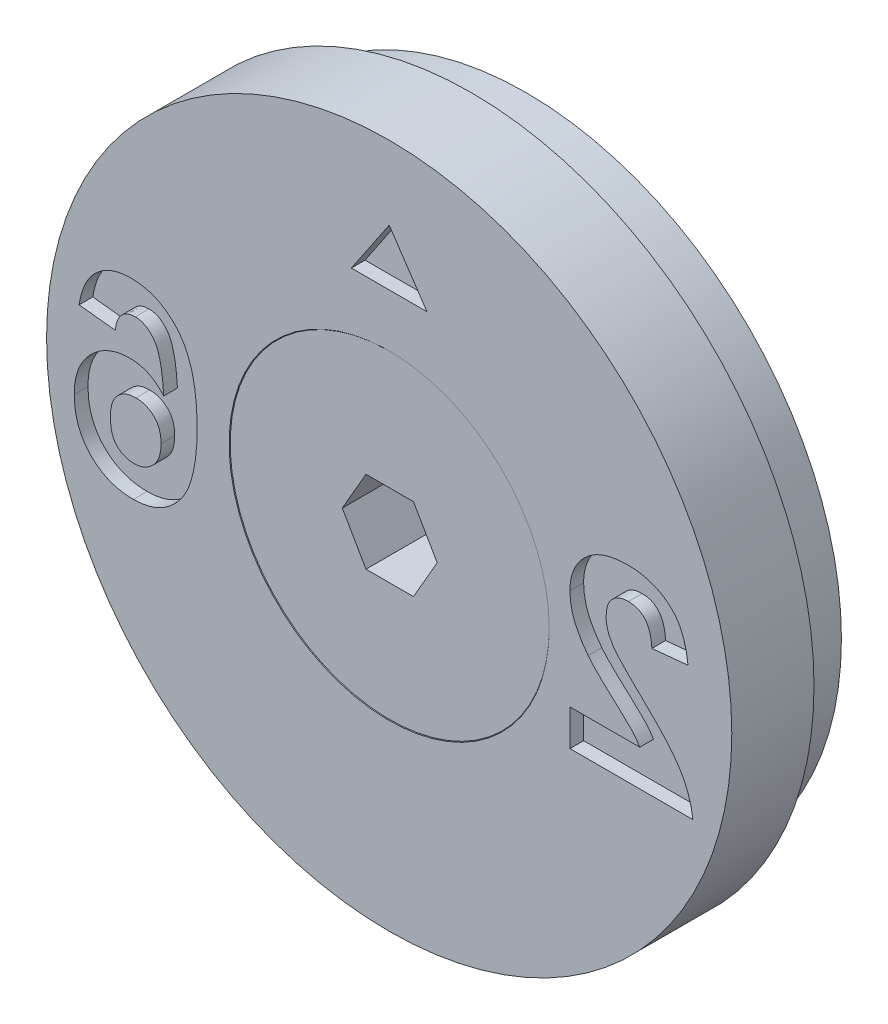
ISO-10303-21;
HEADER;
FILE_DESCRIPTION(('STEP AP214'),'2;1');
FILE_NAME('part.step','',(''),(''),'','','');
FILE_SCHEMA(('AUTOMOTIVE_DESIGN { 1 0 10303 214 1 1 1 1 }'));
ENDSEC;
DATA;
#1=APPLICATION_CONTEXT('core data for automotive mechanical design processes');
#2=APPLICATION_PROTOCOL_DEFINITION('international standard','automotive_design',2000,#1);
#3=PRODUCT_CONTEXT('',#1,'mechanical');
#4=PRODUCT('Part','Part','',(#3));
#5=PRODUCT_RELATED_PRODUCT_CATEGORY('part','',(#4));
#6=PRODUCT_DEFINITION_FORMATION('','',#4);
#7=PRODUCT_DEFINITION_CONTEXT('part definition',#1,'design');
#8=PRODUCT_DEFINITION('design','',#6,#7);
#9=PRODUCT_DEFINITION_SHAPE('','',#8);
#10=(LENGTH_UNIT() NAMED_UNIT(*) SI_UNIT(.MILLI.,.METRE.));
#11=(NAMED_UNIT(*) PLANE_ANGLE_UNIT() SI_UNIT($,.RADIAN.));
#12=(NAMED_UNIT(*) SI_UNIT($,.STERADIAN.) SOLID_ANGLE_UNIT());
#13=UNCERTAINTY_MEASURE_WITH_UNIT(LENGTH_MEASURE(1.E-05),#10,'distance_accuracy_value','');
#14=(GEOMETRIC_REPRESENTATION_CONTEXT(3) GLOBAL_UNCERTAINTY_ASSIGNED_CONTEXT((#13)) GLOBAL_UNIT_ASSIGNED_CONTEXT((#10,
#11,#12)) REPRESENTATION_CONTEXT('',''));
#15=CARTESIAN_POINT('',(0.,0.,0.));
#16=DIRECTION('',(0.,0.,1.));
#17=DIRECTION('',(1.,0.,0.));
#18=AXIS2_PLACEMENT_3D('',#15,#16,#17);
#19=CARTESIAN_POINT('',(0.,0.,-0.0199999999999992));
#20=DIRECTION('',(0.,0.,1.));
#21=DIRECTION('',(1.,0.,0.));
#22=AXIS2_PLACEMENT_3D('',#19,#20,#21);
#23=CYLINDRICAL_SURFACE('',#22,2.5);
#24=CARTESIAN_POINT('',(0.,0.,-3.34));
#25=DIRECTION('',(0.,0.,1.));
#26=DIRECTION('',(1.,0.,0.));
#27=AXIS2_PLACEMENT_3D('',#24,#25,#26);
#28=CIRCLE('',#27,2.5);
#29=CARTESIAN_POINT('',(2.5,0.,-3.34));
#30=VERTEX_POINT('',#29);
#31=EDGE_CURVE('E12',#30,#30,#28,.T.);
#32=ORIENTED_EDGE('',*,*,#31,.F.);
#33=EDGE_LOOP('',(#32));
#34=FACE_BOUND('',#33,.T.);
#35=CARTESIAN_POINT('',(0.,0.,-9.77));
#36=DIRECTION('',(0.,0.,1.));
#37=DIRECTION('',(1.,0.,0.));
#38=AXIS2_PLACEMENT_3D('',#35,#36,#37);
#39=CIRCLE('',#38,2.5);
#40=CARTESIAN_POINT('',(2.5,0.,-9.77));
#41=VERTEX_POINT('',#40);
#42=EDGE_CURVE('E150',#41,#41,#39,.T.);
#43=ORIENTED_EDGE('',*,*,#42,.T.);
#44=EDGE_LOOP('',(#43));
#45=FACE_BOUND('',#44,.T.);
#46=ADVANCED_FACE('F49',(#34,#45),#23,.T.);
#47=CARTESIAN_POINT('',(0.,0.,-3.34));
#48=DIRECTION('',(0.,0.,1.));
#49=DIRECTION('',(1.,0.,0.));
#50=AXIS2_PLACEMENT_3D('',#47,#48,#49);
#51=CONICAL_SURFACE('',#50,2.5,0.785398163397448);
#52=CARTESIAN_POINT('',(0.,0.,-0.0199999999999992));
#53=DIRECTION('',(0.,0.,1.));
#54=DIRECTION('',(1.,0.,0.));
#55=AXIS2_PLACEMENT_3D('',#52,#53,#54);
#56=CIRCLE('',#55,5.82);
#57=CARTESIAN_POINT('',(5.82,0.,-0.0199999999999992));
#58=VERTEX_POINT('',#57);
#59=EDGE_CURVE('E56',#58,#58,#56,.T.);
#60=ORIENTED_EDGE('',*,*,#59,.F.);
#61=EDGE_LOOP('',(#60));
#62=FACE_BOUND('',#61,.T.);
#63=ORIENTED_EDGE('',*,*,#31,.T.);
#64=EDGE_LOOP('',(#63));
#65=FACE_BOUND('',#64,.T.);
#66=ADVANCED_FACE('F165',(#62,#65),#51,.T.);
#67=CARTESIAN_POINT('',(0.,5.82,-0.0199999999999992));
#68=DIRECTION('',(0.,0.,-1.));
#69=DIRECTION('',(-1.,0.,0.));
#70=AXIS2_PLACEMENT_3D('',#67,#68,#69);
#71=PLANE('',#70);
#72=DIRECTION('',(1.,0.,0.));
#73=VECTOR('',#72,1.);
#74=CARTESIAN_POINT('',(-0.866025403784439,-1.5,-0.0199999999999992));
#75=LINE('',#74,#73);
#76=CARTESIAN_POINT('',(-0.866025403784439,-1.5,-0.0199999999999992));
#77=VERTEX_POINT('',#76);
#78=CARTESIAN_POINT('',(0.866025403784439,-1.5,-0.0199999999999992));
#79=VERTEX_POINT('',#78);
#80=EDGE_CURVE('E137',#77,#79,#75,.T.);
#81=ORIENTED_EDGE('',*,*,#80,.F.);
#82=DIRECTION('',(0.5,-0.866025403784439,0.));
#83=VECTOR('',#82,1.);
#84=CARTESIAN_POINT('',(-1.73205080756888,0.,-0.0199999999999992));
#85=LINE('',#84,#83);
#86=CARTESIAN_POINT('',(-1.73205080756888,0.,-0.0199999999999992));
#87=VERTEX_POINT('',#86);
#88=EDGE_CURVE('E63',#87,#77,#85,.T.);
#89=ORIENTED_EDGE('',*,*,#88,.F.);
#90=DIRECTION('',(-0.5,-0.866025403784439,0.));
#91=VECTOR('',#90,1.);
#92=CARTESIAN_POINT('',(-0.866025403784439,1.5,-0.0199999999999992));
#93=LINE('',#92,#91);
#94=CARTESIAN_POINT('',(-0.866025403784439,1.5,-0.0199999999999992));
#95=VERTEX_POINT('',#94);
#96=EDGE_CURVE('E146',#95,#87,#93,.T.);
#97=ORIENTED_EDGE('',*,*,#96,.F.);
#98=DIRECTION('',(-1.,0.,0.));
#99=VECTOR('',#98,1.);
#100=CARTESIAN_POINT('',(0.866025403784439,1.5,-0.0199999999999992));
#101=LINE('',#100,#99);
#102=CARTESIAN_POINT('',(0.866025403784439,1.5,-0.0199999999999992));
#103=VERTEX_POINT('',#102);
#104=EDGE_CURVE('E144',#103,#95,#101,.T.);
#105=ORIENTED_EDGE('',*,*,#104,.F.);
#106=DIRECTION('',(-0.5,0.866025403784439,0.));
#107=VECTOR('',#106,1.);
#108=CARTESIAN_POINT('',(1.73205080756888,0.,-0.0199999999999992));
#109=LINE('',#108,#107);
#110=CARTESIAN_POINT('',(1.73205080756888,0.,-0.0199999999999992));
#111=VERTEX_POINT('',#110);
#112=EDGE_CURVE('E111',#111,#103,#109,.T.);
#113=ORIENTED_EDGE('',*,*,#112,.F.);
#114=DIRECTION('',(0.5,0.866025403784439,0.));
#115=VECTOR('',#114,1.);
#116=CARTESIAN_POINT('',(0.866025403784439,-1.5,-0.0199999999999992));
#117=LINE('',#116,#115);
#118=EDGE_CURVE('E140',#79,#111,#117,.T.);
#119=ORIENTED_EDGE('',*,*,#118,.F.);
#120=EDGE_LOOP('',(#81,#89,#97,#105,#113,#119));
#121=FACE_BOUND('',#120,.T.);
#122=ORIENTED_EDGE('',*,*,#59,.T.);
#123=EDGE_LOOP('',(#122));
#124=FACE_BOUND('',#123,.T.);
#125=ADVANCED_FACE('F163',(#121,#124),#71,.F.);
#126=CARTESIAN_POINT('',(0.,0.,-10.02));
#127=DIRECTION('',(0.,0.,1.));
#128=DIRECTION('',(1.,0.,0.));
#129=AXIS2_PLACEMENT_3D('',#126,#127,#128);
#130=PLANE('',#129);
#131=CARTESIAN_POINT('',(0.,0.,-10.02));
#132=DIRECTION('',(0.,0.,1.));
#133=DIRECTION('',(1.,0.,0.));
#134=AXIS2_PLACEMENT_3D('',#131,#132,#133);
#135=CIRCLE('',#134,2.25);
#136=CARTESIAN_POINT('',(2.25,0.,-10.02));
#137=VERTEX_POINT('',#136);
#138=EDGE_CURVE('E158',#137,#137,#135,.T.);
#139=ORIENTED_EDGE('',*,*,#138,.F.);
#140=EDGE_LOOP('',(#139));
#141=FACE_BOUND('',#140,.T.);
#142=ADVANCED_FACE('F178',(#141),#130,.F.);
#143=CARTESIAN_POINT('',(0.,0.,-10.02));
#144=DIRECTION('',(0.,0.,1.));
#145=DIRECTION('',(1.,0.,0.));
#146=AXIS2_PLACEMENT_3D('',#143,#144,#145);
#147=CONICAL_SURFACE('',#146,2.25,0.78539816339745);
#148=ORIENTED_EDGE('',*,*,#42,.F.);
#149=EDGE_LOOP('',(#148));
#150=FACE_BOUND('',#149,.T.);
#151=ORIENTED_EDGE('',*,*,#138,.T.);
#152=EDGE_LOOP('',(#151));
#153=FACE_BOUND('',#152,.T.);
#154=ADVANCED_FACE('F174',(#150,#153),#147,.T.);
#155=CARTESIAN_POINT('',(-1.73205080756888,0.,-2.52));
#156=DIRECTION('',(-0.866025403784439,-0.5,0.));
#157=DIRECTION('',(0.5,-0.866025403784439,0.));
#158=AXIS2_PLACEMENT_3D('',#155,#156,#157);
#159=PLANE('',#158);
#160=ORIENTED_EDGE('',*,*,#88,.T.);
#161=DIRECTION('',(0.,0.,1.));
#162=VECTOR('',#161,1.);
#163=CARTESIAN_POINT('',(-0.866025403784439,-1.5,-2.52));
#164=LINE('',#163,#162);
#165=CARTESIAN_POINT('',(-0.866025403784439,-1.5,-2.52));
#166=VERTEX_POINT('',#165);
#167=EDGE_CURVE('E93',#166,#77,#164,.T.);
#168=ORIENTED_EDGE('',*,*,#167,.F.);
#169=DIRECTION('',(0.5,-0.866025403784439,0.));
#170=VECTOR('',#169,1.);
#171=CARTESIAN_POINT('',(-1.73205080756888,0.,-2.52));
#172=LINE('',#171,#170);
#173=CARTESIAN_POINT('',(-1.73205080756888,0.,-2.52));
#174=VERTEX_POINT('',#173);
#175=EDGE_CURVE('E148',#174,#166,#172,.T.);
#176=ORIENTED_EDGE('',*,*,#175,.F.);
#177=DIRECTION('',(0.,0.,1.));
#178=VECTOR('',#177,1.);
#179=CARTESIAN_POINT('',(-1.73205080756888,0.,-2.52));
#180=LINE('',#179,#178);
#181=EDGE_CURVE('E71',#174,#87,#180,.T.);
#182=ORIENTED_EDGE('',*,*,#181,.T.);
#183=EDGE_LOOP('',(#160,#168,#176,#182));
#184=FACE_BOUND('',#183,.T.);
#185=ADVANCED_FACE('F177',(#184),#159,.F.);
#186=CARTESIAN_POINT('',(-0.866025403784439,1.5,-2.52));
#187=DIRECTION('',(-0.866025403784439,0.5,0.));
#188=DIRECTION('',(-0.5,-0.866025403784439,0.));
#189=AXIS2_PLACEMENT_3D('',#186,#187,#188);
#190=PLANE('',#189);
#191=ORIENTED_EDGE('',*,*,#96,.T.);
#192=ORIENTED_EDGE('',*,*,#181,.F.);
#193=DIRECTION('',(-0.5,-0.866025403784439,0.));
#194=VECTOR('',#193,1.);
#195=CARTESIAN_POINT('',(-0.866025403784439,1.5,-2.52));
#196=LINE('',#195,#194);
#197=CARTESIAN_POINT('',(-0.866025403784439,1.5,-2.52));
#198=VERTEX_POINT('',#197);
#199=EDGE_CURVE('E123',#198,#174,#196,.T.);
#200=ORIENTED_EDGE('',*,*,#199,.F.);
#201=DIRECTION('',(0.,0.,1.));
#202=VECTOR('',#201,1.);
#203=CARTESIAN_POINT('',(-0.866025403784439,1.5,-2.52));
#204=LINE('',#203,#202);
#205=EDGE_CURVE('E115',#198,#95,#204,.T.);
#206=ORIENTED_EDGE('',*,*,#205,.T.);
#207=EDGE_LOOP('',(#191,#192,#200,#206));
#208=FACE_BOUND('',#207,.T.);
#209=ADVANCED_FACE('F192',(#208),#190,.F.);
#210=CARTESIAN_POINT('',(0.866025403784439,1.5,-2.52));
#211=DIRECTION('',(0.,1.,0.));
#212=DIRECTION('',(-1.,0.,0.));
#213=AXIS2_PLACEMENT_3D('',#210,#211,#212);
#214=PLANE('',#213);
#215=ORIENTED_EDGE('',*,*,#104,.T.);
#216=ORIENTED_EDGE('',*,*,#205,.F.);
#217=DIRECTION('',(-1.,0.,0.));
#218=VECTOR('',#217,1.);
#219=CARTESIAN_POINT('',(0.866025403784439,1.5,-2.52));
#220=LINE('',#219,#218);
#221=CARTESIAN_POINT('',(0.866025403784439,1.5,-2.52));
#222=VERTEX_POINT('',#221);
#223=EDGE_CURVE('E119',#222,#198,#220,.T.);
#224=ORIENTED_EDGE('',*,*,#223,.F.);
#225=DIRECTION('',(0.,0.,1.));
#226=VECTOR('',#225,1.);
#227=CARTESIAN_POINT('',(0.866025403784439,1.5,-2.52));
#228=LINE('',#227,#226);
#229=EDGE_CURVE('E104',#222,#103,#228,.T.);
#230=ORIENTED_EDGE('',*,*,#229,.T.);
#231=EDGE_LOOP('',(#215,#216,#224,#230));
#232=FACE_BOUND('',#231,.T.);
#233=ADVANCED_FACE('F120',(#232),#214,.F.);
#234=CARTESIAN_POINT('',(1.73205080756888,0.,-2.52));
#235=DIRECTION('',(0.866025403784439,0.5,0.));
#236=DIRECTION('',(-0.5,0.866025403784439,0.));
#237=AXIS2_PLACEMENT_3D('',#234,#235,#236);
#238=PLANE('',#237);
#239=ORIENTED_EDGE('',*,*,#112,.T.);
#240=ORIENTED_EDGE('',*,*,#229,.F.);
#241=DIRECTION('',(-0.5,0.866025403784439,0.));
#242=VECTOR('',#241,1.);
#243=CARTESIAN_POINT('',(1.73205080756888,0.,-2.52));
#244=LINE('',#243,#242);
#245=CARTESIAN_POINT('',(1.73205080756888,0.,-2.52));
#246=VERTEX_POINT('',#245);
#247=EDGE_CURVE('E108',#246,#222,#244,.T.);
#248=ORIENTED_EDGE('',*,*,#247,.F.);
#249=DIRECTION('',(0.,0.,1.));
#250=VECTOR('',#249,1.);
#251=CARTESIAN_POINT('',(1.73205080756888,0.,-2.52));
#252=LINE('',#251,#250);
#253=EDGE_CURVE('E116',#246,#111,#252,.T.);
#254=ORIENTED_EDGE('',*,*,#253,.T.);
#255=EDGE_LOOP('',(#239,#240,#248,#254));
#256=FACE_BOUND('',#255,.T.);
#257=ADVANCED_FACE('F106',(#256),#238,.F.);
#258=CARTESIAN_POINT('',(0.866025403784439,-1.5,-2.52));
#259=DIRECTION('',(0.866025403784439,-0.5,0.));
#260=DIRECTION('',(0.5,0.866025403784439,0.));
#261=AXIS2_PLACEMENT_3D('',#258,#259,#260);
#262=PLANE('',#261);
#263=ORIENTED_EDGE('',*,*,#118,.T.);
#264=ORIENTED_EDGE('',*,*,#253,.F.);
#265=DIRECTION('',(0.5,0.866025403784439,0.));
#266=VECTOR('',#265,1.);
#267=CARTESIAN_POINT('',(0.866025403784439,-1.5,-2.52));
#268=LINE('',#267,#266);
#269=CARTESIAN_POINT('',(0.866025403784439,-1.5,-2.52));
#270=VERTEX_POINT('',#269);
#271=EDGE_CURVE('E129',#270,#246,#268,.T.);
#272=ORIENTED_EDGE('',*,*,#271,.F.);
#273=DIRECTION('',(0.,0.,1.));
#274=VECTOR('',#273,1.);
#275=CARTESIAN_POINT('',(0.866025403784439,-1.5,-2.52));
#276=LINE('',#275,#274);
#277=EDGE_CURVE('E153',#270,#79,#276,.T.);
#278=ORIENTED_EDGE('',*,*,#277,.T.);
#279=EDGE_LOOP('',(#263,#264,#272,#278));
#280=FACE_BOUND('',#279,.T.);
#281=ADVANCED_FACE('F196',(#280),#262,.F.);
#282=CARTESIAN_POINT('',(-0.866025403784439,-1.5,-2.52));
#283=DIRECTION('',(0.,-1.,0.));
#284=DIRECTION('',(0.,0.,-1.));
#285=AXIS2_PLACEMENT_3D('',#282,#283,#284);
#286=PLANE('',#285);
#287=ORIENTED_EDGE('',*,*,#80,.T.);
#288=ORIENTED_EDGE('',*,*,#277,.F.);
#289=DIRECTION('',(1.,0.,0.));
#290=VECTOR('',#289,1.);
#291=CARTESIAN_POINT('',(-0.866025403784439,-1.5,-2.52));
#292=LINE('',#291,#290);
#293=EDGE_CURVE('E131',#166,#270,#292,.T.);
#294=ORIENTED_EDGE('',*,*,#293,.F.);
#295=ORIENTED_EDGE('',*,*,#167,.T.);
#296=EDGE_LOOP('',(#287,#288,#294,#295));
#297=FACE_BOUND('',#296,.T.);
#298=ADVANCED_FACE('F193',(#297),#286,.F.);
#299=CARTESIAN_POINT('',(0.,0.,-2.52));
#300=DIRECTION('',(0.,0.,1.));
#301=DIRECTION('',(1.,0.,0.));
#302=AXIS2_PLACEMENT_3D('',#299,#300,#301);
#303=PLANE('',#302);
#304=ORIENTED_EDGE('',*,*,#175,.T.);
#305=ORIENTED_EDGE('',*,*,#293,.T.);
#306=ORIENTED_EDGE('',*,*,#271,.T.);
#307=ORIENTED_EDGE('',*,*,#247,.T.);
#308=ORIENTED_EDGE('',*,*,#223,.T.);
#309=ORIENTED_EDGE('',*,*,#199,.T.);
#310=EDGE_LOOP('',(#304,#305,#306,#307,#308,#309));
#311=FACE_BOUND('',#310,.T.);
#312=ADVANCED_FACE('F126',(#311),#303,.T.);
#313=CLOSED_SHELL('',(#46,#66,#125,#142,#154,#185,#209,#233,#257,#281,#298,#312));
#314=MANIFOLD_SOLID_BREP('B2',#313);
#315=CARTESIAN_POINT('',(0.,12.5,0.));
#316=DIRECTION('',(0.,0.,-1.));
#317=DIRECTION('',(-1.,0.,0.));
#318=AXIS2_PLACEMENT_3D('',#315,#316,#317);
#319=PLANE('',#318);
#320=DIRECTION('',(0.,-1.,0.));
#321=VECTOR('',#320,1.);
#322=CARTESIAN_POINT('',(6.59423076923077,-2.11015384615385,0.));
#323=LINE('',#322,#321);
#324=CARTESIAN_POINT('',(6.59423076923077,-2.11015384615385,0.));
#325=VERTEX_POINT('',#324);
#326=CARTESIAN_POINT('',(6.59423076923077,-3.429,0.));
#327=VERTEX_POINT('',#326);
#328=EDGE_CURVE('E694',#325,#327,#323,.T.);
#329=ORIENTED_EDGE('',*,*,#328,.F.);
#330=DIRECTION('',(-1.,0.,0.));
#331=VECTOR('',#330,1.);
#332=CARTESIAN_POINT('',(9.14262620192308,-2.11015384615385,0.));
#333=LINE('',#332,#331);
#334=CARTESIAN_POINT('',(9.14262620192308,-2.11015384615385,0.));
#335=VERTEX_POINT('',#334);
#336=EDGE_CURVE('E323',#335,#325,#333,.T.);
#337=ORIENTED_EDGE('',*,*,#336,.F.);
#338=CARTESIAN_POINT('',(7.25914903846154,-0.156612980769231,0.));
#339=CARTESIAN_POINT('',(7.28000828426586,-0.182885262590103,0.));
#340=CARTESIAN_POINT('',(7.3246839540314,-0.239154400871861,0.));
#341=CARTESIAN_POINT('',(7.40068900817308,-0.325434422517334,0.));
#342=CARTESIAN_POINT('',(7.48877232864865,-0.419679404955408,0.));
#343=CARTESIAN_POINT('',(7.58768977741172,-0.523653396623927,0.));
#344=CARTESIAN_POINT('',(7.70070879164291,-0.6336743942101,0.));
#345=CARTESIAN_POINT('',(7.82376294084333,-0.754343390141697,0.));
#346=CARTESIAN_POINT('',(7.96226696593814,-0.87948776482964,0.));
#347=CARTESIAN_POINT('',(8.10572357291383,-1.0122292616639,0.));
#348=CARTESIAN_POINT('',(8.24980374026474,-1.14142469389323,0.));
#349=CARTESIAN_POINT('',(8.38223418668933,-1.2641317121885,0.));
#350=CARTESIAN_POINT('',(8.50252509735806,-1.37270106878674,0.));
#351=CARTESIAN_POINT('',(8.6050742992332,-1.47312629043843,0.));
#352=CARTESIAN_POINT('',(8.69591371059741,-1.55855342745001,0.));
#353=CARTESIAN_POINT('',(8.77176917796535,-1.63336308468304,0.));
#354=CARTESIAN_POINT('',(8.83406013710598,-1.69574418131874,0.));
#355=CARTESIAN_POINT('',(8.91989306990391,-1.79298048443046,0.));
#356=CARTESIAN_POINT('',(9.02910573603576,-1.92449262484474,0.));
#357=CARTESIAN_POINT('',(9.10594131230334,-2.05015619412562,0.));
#358=CARTESIAN_POINT('',(9.14262620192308,-2.11015384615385,0.));
#359=B_SPLINE_CURVE_WITH_KNOTS('',3,(#338,#339,#340,#341,#342,#343,#344,#345,#346,#347,#348,
#349,#350,#351,#352,#353,#354,#355,#356,#357,#358),.UNSPECIFIED.,.F.,.F.,(4,1,1,1,1,1,1,1,1,1,1,
1,1,1,1,1,1,1,4),(0.,0.0369753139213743,0.0791925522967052,0.126700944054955,0.179184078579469,
0.237368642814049,0.300558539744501,0.369153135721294,0.443112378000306,0.516018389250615,
0.582473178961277,0.642136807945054,0.694619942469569,0.740679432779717,0.779589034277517,
0.812073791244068,0.837814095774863,0.922564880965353,1.),.UNSPECIFIED.);
#360=CARTESIAN_POINT('',(7.25914903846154,-0.156612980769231,0.));
#361=VERTEX_POINT('',#360);
#362=EDGE_CURVE('E520',#361,#335,#359,.T.);
#363=ORIENTED_EDGE('',*,*,#362,.F.);
#364=CARTESIAN_POINT('',(6.59423076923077,1.56338221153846,0.));
#365=CARTESIAN_POINT('',(6.59590865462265,1.48862686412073,0.));
#366=CARTESIAN_POINT('',(6.59923732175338,1.34032372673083,0.));
#367=CARTESIAN_POINT('',(6.63110683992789,1.12108738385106,0.));
#368=CARTESIAN_POINT('',(6.67979725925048,0.906906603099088,0.));
#369=CARTESIAN_POINT('',(6.75175786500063,0.69725794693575,0.));
#370=CARTESIAN_POINT('',(6.84297351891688,0.487112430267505,0.));
#371=CARTESIAN_POINT('',(6.96055268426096,0.275998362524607,0.));
#372=CARTESIAN_POINT('',(7.09707098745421,0.0575489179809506,0.));
#373=CARTESIAN_POINT('',(7.20395943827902,-0.0836881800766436,0.));
#374=CARTESIAN_POINT('',(7.25914903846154,-0.156612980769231,0.));
#375=B_SPLINE_CURVE_WITH_KNOTS('',3,(#364,#365,#366,#367,#368,#369,#370,#371,#372,#373,#374),
.UNSPECIFIED.,.F.,.F.,(4,1,1,1,1,1,1,1,4),(0.,0.119176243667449,0.236427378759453,
0.352663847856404,0.469086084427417,0.589462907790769,0.717601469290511,0.854189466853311,1.),.UNSPECIFIED.);
#376=CARTESIAN_POINT('',(6.59423076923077,1.56338221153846,0.));
#377=VERTEX_POINT('',#376);
#378=EDGE_CURVE('E523',#377,#361,#375,.T.);
#379=ORIENTED_EDGE('',*,*,#378,.F.);
#380=CARTESIAN_POINT('',(8.69888942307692,3.429,0.));
#381=CARTESIAN_POINT('',(8.6191501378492,3.42746745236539,0.));
#382=CARTESIAN_POINT('',(8.46384786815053,3.42448262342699,0.));
#383=CARTESIAN_POINT('',(8.23713412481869,3.39983388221,0.));
#384=CARTESIAN_POINT('',(8.02415285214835,3.35685523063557,0.));
#385=CARTESIAN_POINT('',(7.82304201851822,3.2999239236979,0.));
#386=CARTESIAN_POINT('',(7.63586692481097,3.22391646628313,0.));
#387=CARTESIAN_POINT('',(7.46106784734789,3.13202661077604,0.));
#388=CARTESIAN_POINT('',(7.30139581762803,3.02076695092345,0.));
#389=CARTESIAN_POINT('',(7.15447070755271,2.89620494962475,0.));
#390=CARTESIAN_POINT('',(7.02313141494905,2.75922713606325,0.));
#391=CARTESIAN_POINT('',(6.90809007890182,2.61311713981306,0.));
#392=CARTESIAN_POINT('',(6.81170882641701,2.45797675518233,0.));
#393=CARTESIAN_POINT('',(6.73083015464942,2.29569697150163,0.));
#394=CARTESIAN_POINT('',(6.67077828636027,2.12366647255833,0.));
#395=CARTESIAN_POINT('',(6.62702188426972,1.94426396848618,0.));
#396=CARTESIAN_POINT('',(6.59800962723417,1.75665250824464,0.));
#397=CARTESIAN_POINT('',(6.59550431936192,1.62851813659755,0.));
#398=CARTESIAN_POINT('',(6.59423076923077,1.56338221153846,0.));
#399=B_SPLINE_CURVE_WITH_KNOTS('',3,(#380,#381,#382,#383,#384,#385,#386,#387,#388,#389,#390,
#391,#392,#393,#394,#395,#396,#397,#398),.UNSPECIFIED.,.F.,.F.,(4,1,1,1,1,1,1,1,1,1,1,1,1,1,1,1,
4),(0.,0.0756723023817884,0.147381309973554,0.216084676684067,0.28169803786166,
0.345459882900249,0.407485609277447,0.468731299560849,0.529782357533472,0.590032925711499,
0.648548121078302,0.70595351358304,0.763101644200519,0.820289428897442,0.878479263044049,
0.938226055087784,1.),.UNSPECIFIED.);
#400=CARTESIAN_POINT('',(8.69888942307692,3.429,0.));
#401=VERTEX_POINT('',#400);
#402=EDGE_CURVE('E1332',#401,#377,#399,.T.);
#403=ORIENTED_EDGE('',*,*,#402,.F.);
#404=CARTESIAN_POINT('',(10.9024615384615,1.36006009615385,0.));
#405=CARTESIAN_POINT('',(10.891858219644,1.4490988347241,0.));
#406=CARTESIAN_POINT('',(10.8713000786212,1.62173072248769,0.));
#407=CARTESIAN_POINT('',(10.8199968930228,1.86968963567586,0.));
#408=CARTESIAN_POINT('',(10.7550233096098,2.09844292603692,0.));
#409=CARTESIAN_POINT('',(10.6732818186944,2.3075660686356,0.));
#410=CARTESIAN_POINT('',(10.5781508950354,2.49838888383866,0.));
#411=CARTESIAN_POINT('',(10.4647780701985,2.66804795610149,0.));
#412=CARTESIAN_POINT('',(10.3371247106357,2.81842262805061,0.));
#413=CARTESIAN_POINT('',(10.1950804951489,2.94943286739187,0.));
#414=CARTESIAN_POINT('',(10.0395484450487,3.06149545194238,0.));
#415=CARTESIAN_POINT('',(9.8763454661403,3.1615285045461,0.));
#416=CARTESIAN_POINT('',(9.70228211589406,3.2435874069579,0.));
#417=CARTESIAN_POINT('',(9.51927483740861,3.311216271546,0.));
#418=CARTESIAN_POINT('',(9.32740633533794,3.36526471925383,0.));
#419=CARTESIAN_POINT('',(9.12578919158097,3.40100082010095,0.));
#420=CARTESIAN_POINT('',(8.91566771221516,3.42613773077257,0.));
#421=CARTESIAN_POINT('',(8.77223791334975,3.4280315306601,0.));
#422=CARTESIAN_POINT('',(8.69888942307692,3.429,0.));
#423=B_SPLINE_CURVE_WITH_KNOTS('',3,(#404,#405,#406,#407,#408,#409,#410,#411,#412,#413,#414,
#415,#416,#417,#418,#419,#420,#421,#422),.UNSPECIFIED.,.F.,.F.,(4,1,1,1,1,1,1,1,1,1,1,1,1,1,1,1,
4),(0.,0.0794357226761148,0.154013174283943,0.224141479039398,0.289934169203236,
0.352732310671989,0.412725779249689,0.470302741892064,0.527168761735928,0.583502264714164,
0.639948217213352,0.696584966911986,0.753726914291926,0.812707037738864,0.872963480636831,
0.93503486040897,1.),.UNSPECIFIED.);
#424=CARTESIAN_POINT('',(10.9024615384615,1.36006009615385,0.));
#425=VERTEX_POINT('',#424);
#426=EDGE_CURVE('E1327',#425,#401,#423,.T.);
#427=ORIENTED_EDGE('',*,*,#426,.F.);
#428=DIRECTION('',(0.995240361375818,0.0974506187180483,0.));
#429=VECTOR('',#428,1.);
#430=CARTESIAN_POINT('',(9.58361538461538,1.23092307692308,0.));
#431=LINE('',#430,#429);
#432=CARTESIAN_POINT('',(9.58361538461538,1.23092307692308,0.));
#433=VERTEX_POINT('',#432);
#434=EDGE_CURVE('E1321',#433,#425,#431,.T.);
#435=ORIENTED_EDGE('',*,*,#434,.F.);
#436=CARTESIAN_POINT('',(8.72636538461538,2.286,0.));
#437=CARTESIAN_POINT('',(8.78618248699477,2.28328991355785,0.));
#438=CARTESIAN_POINT('',(8.90173621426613,2.27805461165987,0.));
#439=CARTESIAN_POINT('',(9.06596313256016,2.23231973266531,0.));
#440=CARTESIAN_POINT('',(9.2096313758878,2.15314784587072,0.));
#441=CARTESIAN_POINT('',(9.31201700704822,2.0629238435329,0.));
#442=CARTESIAN_POINT('',(9.38118335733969,1.9751875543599,0.));
#443=CARTESIAN_POINT('',(9.4283108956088,1.89873115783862,0.));
#444=CARTESIAN_POINT('',(9.46893115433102,1.81185324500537,0.));
#445=CARTESIAN_POINT('',(9.50492409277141,1.71553191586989,0.));
#446=CARTESIAN_POINT('',(9.53335444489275,1.60866370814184,0.));
#447=CARTESIAN_POINT('',(9.55625048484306,1.49206253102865,0.));
#448=CARTESIAN_POINT('',(9.57470138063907,1.3651009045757,0.));
#449=CARTESIAN_POINT('',(9.58056909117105,1.27677733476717,0.));
#450=CARTESIAN_POINT('',(9.58361538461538,1.23092307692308,0.));
#451=B_SPLINE_CURVE_WITH_KNOTS('',3,(#436,#437,#438,#439,#440,#441,#442,#443,#444,#445,#446,
#447,#448,#449,#450),.UNSPECIFIED.,.F.,.F.,(4,1,1,1,1,1,1,1,1,1,1,1,4),(0.,0.116899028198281,
0.225823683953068,0.330086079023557,0.435451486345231,0.490306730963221,0.548244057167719,
0.610766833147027,0.677675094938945,0.749188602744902,0.826858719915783,0.910111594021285,1.),.UNSPECIFIED.);
#452=CARTESIAN_POINT('',(8.72636538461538,2.286,0.));
#453=VERTEX_POINT('',#452);
#454=EDGE_CURVE('E1301',#453,#433,#451,.T.);
#455=ORIENTED_EDGE('',*,*,#454,.F.);
#456=CARTESIAN_POINT('',(7.91307692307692,1.38616225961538,0.));
#457=CARTESIAN_POINT('',(7.91554694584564,1.4545870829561,0.));
#458=CARTESIAN_POINT('',(7.92022003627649,1.58404151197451,0.));
#459=CARTESIAN_POINT('',(7.95940470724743,1.76672564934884,0.));
#460=CARTESIAN_POINT('',(8.02889236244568,1.92376854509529,0.));
#461=CARTESIAN_POINT('',(8.12456407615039,2.05565224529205,0.));
#462=CARTESIAN_POINT('',(8.24554114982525,2.15898261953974,0.));
#463=CARTESIAN_POINT('',(8.38696686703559,2.23533373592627,0.));
#464=CARTESIAN_POINT('',(8.5509114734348,2.27754595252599,0.));
#465=CARTESIAN_POINT('',(8.66614141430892,2.28309817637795,0.));
#466=CARTESIAN_POINT('',(8.72636538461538,2.286,0.));
#467=B_SPLINE_CURVE_WITH_KNOTS('',3,(#456,#457,#458,#459,#460,#461,#462,#463,#464,#465,#466),
.UNSPECIFIED.,.F.,.F.,(4,1,1,1,1,1,1,1,4),(0.,0.149140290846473,0.282161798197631,
0.404655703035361,0.521109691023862,0.63441645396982,0.748796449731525,0.868710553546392,1.),.UNSPECIFIED.);
#468=CARTESIAN_POINT('',(7.91307692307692,1.38616225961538,0.));
#469=VERTEX_POINT('',#468);
#470=EDGE_CURVE('E1299',#469,#453,#467,.T.);
#471=ORIENTED_EDGE('',*,*,#470,.F.);
#472=CARTESIAN_POINT('',(8.17409855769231,0.593480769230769,0.));
#473=CARTESIAN_POINT('',(8.13439107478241,0.659439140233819,0.));
#474=CARTESIAN_POINT('',(8.05779994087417,0.786665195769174,0.));
#475=CARTESIAN_POINT('',(7.97381140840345,0.986730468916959,0.));
#476=CARTESIAN_POINT('',(7.9233983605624,1.18675441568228,0.));
#477=CARTESIAN_POINT('',(7.91648032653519,1.32040927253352,0.));
#478=CARTESIAN_POINT('',(7.91307692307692,1.38616225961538,0.));
#479=B_SPLINE_CURVE_WITH_KNOTS('',3,(#472,#473,#474,#475,#476,#477,#478),.UNSPECIFIED.,.F.,.F.,
(4,1,1,1,4),(0.,0.272795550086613,0.526191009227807,0.766904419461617,1.),.UNSPECIFIED.);
#480=CARTESIAN_POINT('',(8.17409855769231,0.593480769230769,0.));
#481=VERTEX_POINT('',#480);
#482=EDGE_CURVE('E1292',#481,#469,#479,.T.);
#483=ORIENTED_EDGE('',*,*,#482,.F.);
#484=CARTESIAN_POINT('',(9.22368028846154,-0.513800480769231,0.));
#485=CARTESIAN_POINT('',(9.15587503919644,-0.448349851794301,0.));
#486=CARTESIAN_POINT('',(9.02679381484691,-0.323751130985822,0.));
#487=CARTESIAN_POINT('',(8.84298190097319,-0.145330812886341,0.));
#488=CARTESIAN_POINT('',(8.68139228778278,0.0186881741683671,0.));
#489=CARTESIAN_POINT('',(8.5386463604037,0.164055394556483,0.));
#490=CARTESIAN_POINT('',(8.41804175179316,0.294472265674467,0.));
#491=CARTESIAN_POINT('',(8.31799201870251,0.40789061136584,0.));
#492=CARTESIAN_POINT('',(8.23723004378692,0.504772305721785,0.));
#493=CARTESIAN_POINT('',(8.19348928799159,0.566234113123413,0.));
#494=CARTESIAN_POINT('',(8.17409855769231,0.593480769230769,0.));
#495=B_SPLINE_CURVE_WITH_KNOTS('',3,(#484,#485,#486,#487,#488,#489,#490,#491,#492,#493,#494),
.UNSPECIFIED.,.F.,.F.,(4,1,1,1,1,1,1,1,4),(0.,0.18509006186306,0.352356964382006,
0.503079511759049,0.637279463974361,0.752473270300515,0.851885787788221,0.934339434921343,1.),.UNSPECIFIED.);
#496=CARTESIAN_POINT('',(9.22368028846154,-0.513800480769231,0.));
#497=VERTEX_POINT('',#496);
#498=EDGE_CURVE('E1284',#497,#481,#495,.T.);
#499=ORIENTED_EDGE('',*,*,#498,.F.);
#500=CARTESIAN_POINT('',(11.0783076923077,-3.429,0.));
#501=CARTESIAN_POINT('',(11.063125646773,-3.31628546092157,0.));
#502=CARTESIAN_POINT('',(11.032770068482,-3.090919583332,0.));
#503=CARTESIAN_POINT('',(10.938921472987,-2.76171676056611,0.));
#504=CARTESIAN_POINT('',(10.8136657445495,-2.44047105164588,0.));
#505=CARTESIAN_POINT('',(10.6777244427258,-2.17905502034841,0.));
#506=CARTESIAN_POINT('',(10.5425157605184,-1.96862411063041,0.));
#507=CARTESIAN_POINT('',(10.4198409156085,-1.79619539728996,0.));
#508=CARTESIAN_POINT('',(10.2734943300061,-1.61273864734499,0.));
#509=CARTESIAN_POINT('',(10.1055996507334,-1.41677285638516,0.));
#510=CARTESIAN_POINT('',(9.91708473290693,-1.20768543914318,0.));
#511=CARTESIAN_POINT('',(9.70654313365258,-0.98625373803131,0.));
#512=CARTESIAN_POINT('',(9.4729705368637,-0.753537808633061,0.));
#513=CARTESIAN_POINT('',(9.3086480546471,-0.595512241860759,0.));
#514=CARTESIAN_POINT('',(9.22368028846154,-0.513800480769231,0.));
#515=B_SPLINE_CURVE_WITH_KNOTS('',3,(#500,#501,#502,#503,#504,#505,#506,#507,#508,#509,#510,
#511,#512,#513,#514),.UNSPECIFIED.,.F.,.F.,(4,1,1,1,1,1,1,1,1,1,1,1,4),(0.,0.0963574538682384,
0.192660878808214,0.289454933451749,0.388479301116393,0.441921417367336,0.501521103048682,
0.567882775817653,0.640891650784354,0.72037065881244,0.806636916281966,0.900015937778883,1.),.UNSPECIFIED.);
#516=CARTESIAN_POINT('',(11.0783076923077,-3.429,0.));
#517=VERTEX_POINT('',#516);
#518=EDGE_CURVE('E1293',#517,#497,#515,.T.);
#519=ORIENTED_EDGE('',*,*,#518,.F.);
#520=DIRECTION('',(1.,0.,0.));
#521=VECTOR('',#520,1.);
#522=CARTESIAN_POINT('',(6.59423076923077,-3.429,0.));
#523=LINE('',#522,#521);
#524=EDGE_CURVE('E1400',#327,#517,#523,.T.);
#525=ORIENTED_EDGE('',*,*,#524,.F.);
#526=EDGE_LOOP('',(#329,#337,#363,#379,#403,#427,#435,#455,#471,#483,#499,#519,#525));
#527=FACE_BOUND('',#526,.T.);
#528=DIRECTION('',(0.994071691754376,-0.108726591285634,0.));
#529=VECTOR('',#528,1.);
#530=CARTESIAN_POINT('',(-11.3139415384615,1.63894110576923,0.));
#531=LINE('',#530,#529);
#532=CARTESIAN_POINT('',(-11.3139415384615,1.63894110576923,0.));
#533=VERTEX_POINT('',#532);
#534=CARTESIAN_POINT('',(-9.99509538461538,1.49469230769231,0.));
#535=VERTEX_POINT('',#534);
#536=EDGE_CURVE('E699',#533,#535,#531,.T.);
#537=ORIENTED_EDGE('',*,*,#536,.F.);
#538=CARTESIAN_POINT('',(-9.43183817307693,3.429,0.));
#539=CARTESIAN_POINT('',(-9.49373345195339,3.42788647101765,0.));
#540=CARTESIAN_POINT('',(-9.61473080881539,3.42570966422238,0.));
#541=CARTESIAN_POINT('',(-9.79206985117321,3.40259379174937,0.));
#542=CARTESIAN_POINT('',(-9.96124964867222,3.36724587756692,0.));
#543=CARTESIAN_POINT('',(-10.1227136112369,3.31831615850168,0.));
#544=CARTESIAN_POINT('',(-10.2753249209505,3.25278979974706,0.));
#545=CARTESIAN_POINT('',(-10.4196895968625,3.17296352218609,0.));
#546=CARTESIAN_POINT('',(-10.5562929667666,3.0790535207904,0.));
#547=CARTESIAN_POINT('',(-10.6844242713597,2.97166441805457,0.));
#548=CARTESIAN_POINT('',(-10.8030522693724,2.85047120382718,0.));
#549=CARTESIAN_POINT('',(-10.9101706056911,2.71519967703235,0.));
#550=CARTESIAN_POINT('',(-11.0064886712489,2.56748239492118,0.));
#551=CARTESIAN_POINT('',(-11.0924280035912,2.40744194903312,0.));
#552=CARTESIAN_POINT('',(-11.164512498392,2.23354555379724,0.));
#553=CARTESIAN_POINT('',(-11.2264810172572,2.04716068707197,0.));
#554=CARTESIAN_POINT('',(-11.2774458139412,1.84788692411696,0.));
#555=CARTESIAN_POINT('',(-11.3015908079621,1.70965167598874,0.));
#556=CARTESIAN_POINT('',(-11.3139415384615,1.63894110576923,0.));
#557=B_SPLINE_CURVE_WITH_KNOTS('',3,(#538,#539,#540,#541,#542,#543,#544,#545,#546,#547,#548,
#549,#550,#551,#552,#553,#554,#555,#556),.UNSPECIFIED.,.F.,.F.,(4,1,1,1,1,1,1,1,1,1,1,1,1,1,1,1,
4),(0.,0.064751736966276,0.126581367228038,0.186839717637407,0.245514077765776,
0.302849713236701,0.360345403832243,0.417912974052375,0.476091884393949,0.535068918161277,
0.595103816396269,0.656390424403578,0.719434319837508,0.784953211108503,0.853160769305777,
0.924888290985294,1.),.UNSPECIFIED.);
#558=CARTESIAN_POINT('',(-9.43183817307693,3.429,0.));
#559=VERTEX_POINT('',#558);
#560=EDGE_CURVE('E331',#559,#533,#557,.T.);
#561=ORIENTED_EDGE('',*,*,#560,.F.);
#562=CARTESIAN_POINT('',(-7.00571076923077,-0.0920444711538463,0.));
#563=CARTESIAN_POINT('',(-7.0077612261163,0.0582186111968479,0.));
#564=CARTESIAN_POINT('',(-7.01172320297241,0.348563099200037,0.));
#565=CARTESIAN_POINT('',(-7.04360485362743,0.767780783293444,0.));
#566=CARTESIAN_POINT('',(-7.09424604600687,1.15491049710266,0.));
#567=CARTESIAN_POINT('',(-7.16801763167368,1.50907924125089,0.));
#568=CARTESIAN_POINT('',(-7.26237718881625,1.83102188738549,0.));
#569=CARTESIAN_POINT('',(-7.37677290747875,2.12138542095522,0.));
#570=CARTESIAN_POINT('',(-7.51407876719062,2.37911864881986,0.));
#571=CARTESIAN_POINT('',(-7.67371831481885,2.60338339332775,0.));
#572=CARTESIAN_POINT('',(-7.84936782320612,2.79832848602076,0.));
#573=CARTESIAN_POINT('',(-8.03810399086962,2.96659919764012,0.));
#574=CARTESIAN_POINT('',(-8.23920628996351,3.1098226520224,0.));
#575=CARTESIAN_POINT('',(-8.45266989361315,3.2276371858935,0.));
#576=CARTESIAN_POINT('',(-8.680247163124,3.31695172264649,0.));
#577=CARTESIAN_POINT('',(-8.91977945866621,3.38144798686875,0.));
#578=CARTESIAN_POINT('',(-9.17166910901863,3.42289871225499,0.));
#579=CARTESIAN_POINT('',(-9.34420953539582,3.42694499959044,0.));
#580=CARTESIAN_POINT('',(-9.43183817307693,3.429,0.));
#581=B_SPLINE_CURVE_WITH_KNOTS('',3,(#562,#563,#564,#565,#566,#567,#568,#569,#570,#571,#572,
#573,#574,#575,#576,#577,#578,#579,#580),.UNSPECIFIED.,.F.,.F.,(4,1,1,1,1,1,1,1,1,1,1,1,1,1,1,1,
4),(0.,0.0932311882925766,0.180145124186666,0.260720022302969,0.335343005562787,
0.40439372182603,0.46866345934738,0.528671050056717,0.585123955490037,0.639046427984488,
0.691174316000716,0.741714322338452,0.79194664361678,0.84207517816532,0.893016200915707,
0.945665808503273,1.),.UNSPECIFIED.);
#582=CARTESIAN_POINT('',(-7.00571076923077,-0.0920444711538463,0.));
#583=VERTEX_POINT('',#582);
#584=EDGE_CURVE('E627',#583,#559,#581,.T.);
#585=ORIENTED_EDGE('',*,*,#584,.F.);
#586=CARTESIAN_POINT('',(-9.33292471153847,-3.51692307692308,0.));
#587=CARTESIAN_POINT('',(-9.24990427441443,-3.51460039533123,0.));
#588=CARTESIAN_POINT('',(-9.08667132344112,-3.51003359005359,0.));
#589=CARTESIAN_POINT('',(-8.84771641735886,-3.47245109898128,0.));
#590=CARTESIAN_POINT('',(-8.62053843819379,-3.40886746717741,0.));
#591=CARTESIAN_POINT('',(-8.40516561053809,-3.32007021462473,0.));
#592=CARTESIAN_POINT('',(-8.19980782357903,-3.20837701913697,0.));
#593=CARTESIAN_POINT('',(-8.00637197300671,-3.06963370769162,0.));
#594=CARTESIAN_POINT('',(-7.8253706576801,-2.90516336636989,0.));
#595=CARTESIAN_POINT('',(-7.65440984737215,-2.71719330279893,0.));
#596=CARTESIAN_POINT('',(-7.49884009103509,-2.50007302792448,0.));
#597=CARTESIAN_POINT('',(-7.36635555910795,-2.24912765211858,0.));
#598=CARTESIAN_POINT('',(-7.2539954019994,-1.96710552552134,0.));
#599=CARTESIAN_POINT('',(-7.1625177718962,-1.65328337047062,0.));
#600=CARTESIAN_POINT('',(-7.09190364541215,-1.30768607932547,0.));
#601=CARTESIAN_POINT('',(-7.04263070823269,-0.930284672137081,0.));
#602=CARTESIAN_POINT('',(-7.00990318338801,-0.521703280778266,0.));
#603=CARTESIAN_POINT('',(-7.00714129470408,-0.23865161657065,0.));
#604=CARTESIAN_POINT('',(-7.00571076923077,-0.0920444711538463,0.));
#605=B_SPLINE_CURVE_WITH_KNOTS('',3,(#586,#587,#588,#589,#590,#591,#592,#593,#594,#595,#596,
#597,#598,#599,#600,#601,#602,#603,#604),.UNSPECIFIED.,.F.,.F.,(4,1,1,1,1,1,1,1,1,1,1,1,1,1,1,1,
4),(0.,0.0532594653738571,0.104717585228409,0.154775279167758,0.204330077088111,
0.253913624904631,0.30447604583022,0.356706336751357,0.41059695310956,0.467274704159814,
0.52762561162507,0.59224090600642,0.661798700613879,0.737130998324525,0.818387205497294,
0.905933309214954,1.),.UNSPECIFIED.);
#606=CARTESIAN_POINT('',(-9.33292471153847,-3.51692307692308,0.));
#607=VERTEX_POINT('',#606);
#608=EDGE_CURVE('E785',#607,#583,#605,.T.);
#609=ORIENTED_EDGE('',*,*,#608,.F.);
#610=CARTESIAN_POINT('',(-11.4897876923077,-1.28037980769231,0.));
#611=CARTESIAN_POINT('',(-11.4878840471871,-1.36287714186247,0.));
#612=CARTESIAN_POINT('',(-11.4841714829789,-1.52376671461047,0.));
#613=CARTESIAN_POINT('',(-11.4568444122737,-1.75939329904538,0.));
#614=CARTESIAN_POINT('',(-11.4085731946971,-1.98179826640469,0.));
#615=CARTESIAN_POINT('',(-11.342624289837,-2.19276598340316,0.));
#616=CARTESIAN_POINT('',(-11.2573213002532,-2.39062475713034,0.));
#617=CARTESIAN_POINT('',(-11.1539836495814,-2.57700515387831,0.));
#618=CARTESIAN_POINT('',(-11.0291143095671,-2.74872208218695,0.));
#619=CARTESIAN_POINT('',(-10.8883801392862,-2.90808538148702,0.));
#620=CARTESIAN_POINT('',(-10.7314893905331,-3.05029649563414,0.));
#621=CARTESIAN_POINT('',(-10.5642884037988,-3.17622611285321,0.));
#622=CARTESIAN_POINT('',(-10.3849226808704,-3.28090772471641,0.));
#623=CARTESIAN_POINT('',(-10.1960434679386,-3.36901522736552,0.));
#624=CARTESIAN_POINT('',(-9.99440662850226,-3.43367457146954,0.));
#625=CARTESIAN_POINT('',(-9.78356698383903,-3.48216582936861,0.));
#626=CARTESIAN_POINT('',(-9.56181013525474,-3.51174116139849,0.));
#627=CARTESIAN_POINT('',(-9.4104066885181,-3.51516890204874,0.));
#628=CARTESIAN_POINT('',(-9.33292471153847,-3.51692307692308,0.));
#629=B_SPLINE_CURVE_WITH_KNOTS('',3,(#610,#611,#612,#613,#614,#615,#616,#617,#618,#619,#620,
#621,#622,#623,#624,#625,#626,#627,#628),.UNSPECIFIED.,.F.,.F.,(4,1,1,1,1,1,1,1,1,1,1,1,1,1,1,1,
4),(0.,0.0708046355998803,0.138086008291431,0.203231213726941,0.265884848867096,
0.327509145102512,0.387868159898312,0.448411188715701,0.509386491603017,0.570040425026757,
0.629864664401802,0.68871511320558,0.747985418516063,0.808394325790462,0.870086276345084,
0.933515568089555,1.),.UNSPECIFIED.);
#630=CARTESIAN_POINT('',(-11.4897876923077,-1.28037980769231,0.));
#631=VERTEX_POINT('',#630);
#632=EDGE_CURVE('E793',#631,#607,#629,.T.);
#633=ORIENTED_EDGE('',*,*,#632,.F.);
#634=CARTESIAN_POINT('',(-9.46343552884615,0.879230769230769,0.));
#635=CARTESIAN_POINT('',(-9.53174615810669,0.877263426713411,0.));
#636=CARTESIAN_POINT('',(-9.66663539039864,0.873378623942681,0.));
#637=CARTESIAN_POINT('',(-9.86535854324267,0.846131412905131,0.));
#638=CARTESIAN_POINT('',(-10.0560464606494,0.797136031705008,0.));
#639=CARTESIAN_POINT('',(-10.2395617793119,0.730857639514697,0.));
#640=CARTESIAN_POINT('',(-10.4168115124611,0.647396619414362,0.));
#641=CARTESIAN_POINT('',(-10.5844050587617,0.541747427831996,0.));
#642=CARTESIAN_POINT('',(-10.744973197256,0.418565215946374,0.));
#643=CARTESIAN_POINT('',(-10.8963076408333,0.277831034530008,0.));
#644=CARTESIAN_POINT('',(-11.0353476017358,0.122894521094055,0.));
#645=CARTESIAN_POINT('',(-11.15810613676,-0.0444491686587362,0.));
#646=CARTESIAN_POINT('',(-11.2591323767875,-0.224711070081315,0.));
#647=CARTESIAN_POINT('',(-11.3454977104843,-0.413855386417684,0.));
#648=CARTESIAN_POINT('',(-11.4097568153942,-0.615616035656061,0.));
#649=CARTESIAN_POINT('',(-11.4564021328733,-0.82708968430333,0.));
#650=CARTESIAN_POINT('',(-11.4842461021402,-1.05021748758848,0.));
#651=CARTESIAN_POINT('',(-11.487911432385,-1.20245193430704,0.));
#652=CARTESIAN_POINT('',(-11.4897876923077,-1.28037980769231,0.));
#653=B_SPLINE_CURVE_WITH_KNOTS('',3,(#634,#635,#636,#637,#638,#639,#640,#641,#642,#643,#644,
#645,#646,#647,#648,#649,#650,#651,#652),.UNSPECIFIED.,.F.,.F.,(4,1,1,1,1,1,1,1,1,1,1,1,1,1,1,1,
4),(0.,0.0619593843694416,0.12234777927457,0.181484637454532,0.24021748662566,0.299114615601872,
0.358819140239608,0.419550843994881,0.482449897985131,0.545990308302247,0.608137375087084,
0.670271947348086,0.733113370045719,0.796428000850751,0.861936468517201,0.9293261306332,1.),.UNSPECIFIED.);
#654=CARTESIAN_POINT('',(-9.46343552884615,0.879230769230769,0.));
#655=VERTEX_POINT('',#654);
#656=EDGE_CURVE('E801',#655,#631,#653,.T.);
#657=ORIENTED_EDGE('',*,*,#656,.F.);
#658=CARTESIAN_POINT('',(-8.22426966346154,0.304983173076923,0.));
#659=CARTESIAN_POINT('',(-8.26642016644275,0.350764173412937,0.));
#660=CARTESIAN_POINT('',(-8.34907286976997,0.440535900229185,0.));
#661=CARTESIAN_POINT('',(-8.48621978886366,0.557577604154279,0.));
#662=CARTESIAN_POINT('',(-8.62990159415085,0.657640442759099,0.));
#663=CARTESIAN_POINT('',(-8.78168174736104,0.7397331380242,0.));
#664=CARTESIAN_POINT('',(-8.94238871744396,0.80082414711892,0.));
#665=CARTESIAN_POINT('',(-9.10911142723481,0.847209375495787,0.));
#666=CARTESIAN_POINT('',(-9.28403228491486,0.873192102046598,0.));
#667=CARTESIAN_POINT('',(-9.40290776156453,0.877193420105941,0.));
#668=CARTESIAN_POINT('',(-9.46343552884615,0.879230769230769,0.));
#669=B_SPLINE_CURVE_WITH_KNOTS('',3,(#658,#659,#660,#661,#662,#663,#664,#665,#666,#667,#668),
.UNSPECIFIED.,.F.,.F.,(4,1,1,1,1,1,1,1,4),(0.,0.132218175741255,0.259265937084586,
0.382426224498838,0.503963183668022,0.625109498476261,0.747226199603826,0.87129528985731,1.),.UNSPECIFIED.);
#670=CARTESIAN_POINT('',(-8.22426966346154,0.304983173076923,0.));
#671=VERTEX_POINT('',#670);
#672=EDGE_CURVE('E809',#671,#655,#669,.T.);
#673=ORIENTED_EDGE('',*,*,#672,.F.);
#674=CARTESIAN_POINT('',(-9.26286100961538,2.286,0.));
#675=CARTESIAN_POINT('',(-9.22978464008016,2.28519121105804,0.));
#676=CARTESIAN_POINT('',(-9.16396433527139,2.28358176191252,0.));
#677=CARTESIAN_POINT('',(-9.06808906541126,2.26314815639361,0.));
#678=CARTESIAN_POINT('',(-8.97565377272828,2.23282455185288,0.));
#679=CARTESIAN_POINT('',(-8.88741285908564,2.18987756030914,0.));
#680=CARTESIAN_POINT('',(-8.80292605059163,2.13446242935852,0.));
#681=CARTESIAN_POINT('',(-8.72347774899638,2.06591679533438,0.));
#682=CARTESIAN_POINT('',(-8.64541538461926,1.98785385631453,0.));
#683=CARTESIAN_POINT('',(-8.57333364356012,1.89358919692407,0.));
#684=CARTESIAN_POINT('',(-8.50417960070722,1.78197322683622,0.));
#685=CARTESIAN_POINT('',(-8.44463517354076,1.64533422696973,0.));
#686=CARTESIAN_POINT('',(-8.3915631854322,1.48379914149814,0.));
#687=CARTESIAN_POINT('',(-8.34612220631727,1.29657681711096,0.));
#688=CARTESIAN_POINT('',(-8.30488498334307,1.08485561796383,0.));
#689=CARTESIAN_POINT('',(-8.2710821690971,0.847778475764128,0.));
#690=CARTESIAN_POINT('',(-8.24403335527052,0.585132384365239,0.));
#691=CARTESIAN_POINT('',(-8.23105698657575,0.4011930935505,0.));
#692=CARTESIAN_POINT('',(-8.22426966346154,0.304983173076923,0.));
#693=B_SPLINE_CURVE_WITH_KNOTS('',3,(#674,#675,#676,#677,#678,#679,#680,#681,#682,#683,#684,
#685,#686,#687,#688,#689,#690,#691,#692),.UNSPECIFIED.,.F.,.F.,(4,1,1,1,1,1,1,1,1,1,1,1,1,1,1,1,
4),(0.,0.0401536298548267,0.0799036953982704,0.118642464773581,0.158240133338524,
0.198858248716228,0.241137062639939,0.285631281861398,0.332856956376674,0.385095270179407,
0.444912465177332,0.513585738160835,0.591645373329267,0.679009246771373,0.775790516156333,
0.88272665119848,1.),.UNSPECIFIED.);
#694=CARTESIAN_POINT('',(-9.26286100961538,2.286,0.));
#695=VERTEX_POINT('',#694);
#696=EDGE_CURVE('E817',#695,#671,#693,.T.);
#697=ORIENTED_EDGE('',*,*,#696,.F.);
#698=CARTESIAN_POINT('',(-9.99509538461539,1.49469230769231,0.));
#699=CARTESIAN_POINT('',(-9.98625954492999,1.55821377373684,0.));
#700=CARTESIAN_POINT('',(-9.96963210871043,1.67774956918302,0.));
#701=CARTESIAN_POINT('',(-9.92038249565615,1.8427088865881,0.));
#702=CARTESIAN_POINT('',(-9.85182146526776,1.98148177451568,0.));
#703=CARTESIAN_POINT('',(-9.76381673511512,2.0942622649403,0.));
#704=CARTESIAN_POINT('',(-9.65899382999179,2.1810628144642,0.));
#705=CARTESIAN_POINT('',(-9.53955378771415,2.24273989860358,0.));
#706=CARTESIAN_POINT('',(-9.40557252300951,2.27935291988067,0.));
#707=CARTESIAN_POINT('',(-9.31163702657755,2.28372815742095,0.));
#708=CARTESIAN_POINT('',(-9.26286100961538,2.286,0.));
#709=B_SPLINE_CURVE_WITH_KNOTS('',3,(#698,#699,#700,#701,#702,#703,#704,#705,#706,#707,#708),
.UNSPECIFIED.,.F.,.F.,(4,1,1,1,1,1,1,1,4),(0.,0.160089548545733,0.301259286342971,
0.428171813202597,0.544692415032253,0.656041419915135,0.765564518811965,0.878269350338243,1.),.UNSPECIFIED.);
#710=EDGE_CURVE('E825',#535,#695,#709,.T.);
#711=ORIENTED_EDGE('',*,*,#710,.F.);
#712=EDGE_LOOP('',(#537,#561,#585,#609,#633,#657,#673,#697,#711));
#713=FACE_BOUND('',#712,.T.);
#714=CARTESIAN_POINT('',(0.,0.,0.));
#715=DIRECTION('',(0.,0.,1.));
#716=DIRECTION('',(1.,0.,0.));
#717=AXIS2_PLACEMENT_3D('',#714,#715,#716);
#718=CIRCLE('',#717,12.5);
#719=CARTESIAN_POINT('',(12.5,0.,0.));
#720=VERTEX_POINT('',#719);
#721=EDGE_CURVE('E47',#720,#720,#718,.T.);
#722=ORIENTED_EDGE('',*,*,#721,.T.);
#723=EDGE_LOOP('',(#722));
#724=FACE_BOUND('',#723,.T.);
#725=CARTESIAN_POINT('',(0.,0.,0.));
#726=DIRECTION('',(0.,0.,1.));
#727=DIRECTION('',(1.,0.,0.));
#728=AXIS2_PLACEMENT_3D('',#725,#726,#727);
#729=CIRCLE('',#728,5.84);
#730=CARTESIAN_POINT('',(5.84,0.,0.));
#731=VERTEX_POINT('',#730);
#732=EDGE_CURVE('E316',#731,#731,#729,.T.);
#733=ORIENTED_EDGE('',*,*,#732,.F.);
#734=EDGE_LOOP('',(#733));
#735=FACE_BOUND('',#734,.T.);
#736=DIRECTION('',(-0.559192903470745,0.829037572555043,0.));
#737=VECTOR('',#736,1.);
#738=CARTESIAN_POINT('',(1.3800444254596,7.76799984,0.));
#739=LINE('',#738,#737);
#740=CARTESIAN_POINT('',(1.3800444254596,7.76799984,0.));
#741=VERTEX_POINT('',#740);
#742=CARTESIAN_POINT('',(0.,9.81399984,0.));
#743=VERTEX_POINT('',#742);
#744=EDGE_CURVE('E709',#741,#743,#739,.T.);
#745=ORIENTED_EDGE('',*,*,#744,.F.);
#746=DIRECTION('',(1.,0.,0.));
#747=VECTOR('',#746,1.);
#748=CARTESIAN_POINT('',(-1.3800444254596,7.76799984,0.));
#749=LINE('',#748,#747);
#750=CARTESIAN_POINT('',(-1.3800444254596,7.76799984,0.));
#751=VERTEX_POINT('',#750);
#752=EDGE_CURVE('E710',#751,#741,#749,.T.);
#753=ORIENTED_EDGE('',*,*,#752,.F.);
#754=DIRECTION('',(-0.559192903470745,-0.829037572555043,0.));
#755=VECTOR('',#754,1.);
#756=CARTESIAN_POINT('',(0.,9.81399984,0.));
#757=LINE('',#756,#755);
#758=EDGE_CURVE('E712',#743,#751,#757,.T.);
#759=ORIENTED_EDGE('',*,*,#758,.F.);
#760=EDGE_LOOP('',(#745,#753,#759));
#761=FACE_BOUND('',#760,.T.);
#762=ADVANCED_FACE('F308',(#527,#713,#724,#735,#761),#319,.F.);
#763=CARTESIAN_POINT('',(0.,0.,3.12219627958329));
#764=DIRECTION('',(0.,0.,1.));
#765=DIRECTION('',(1.,0.,0.));
#766=AXIS2_PLACEMENT_3D('',#763,#764,#765);
#767=CYLINDRICAL_SURFACE('',#766,12.5);
#768=ORIENTED_EDGE('',*,*,#721,.F.);
#769=EDGE_LOOP('',(#768));
#770=FACE_BOUND('',#769,.T.);
#771=CARTESIAN_POINT('',(0.,0.,-3.));
#772=DIRECTION('',(0.,0.,1.));
#773=DIRECTION('',(1.,0.,0.));
#774=AXIS2_PLACEMENT_3D('',#771,#772,#773);
#775=CIRCLE('',#774,12.5);
#776=CARTESIAN_POINT('',(12.5,0.,-3.));
#777=VERTEX_POINT('',#776);
#778=EDGE_CURVE('E723',#777,#777,#775,.T.);
#779=ORIENTED_EDGE('',*,*,#778,.T.);
#780=EDGE_LOOP('',(#779));
#781=FACE_BOUND('',#780,.T.);
#782=ADVANCED_FACE('F310',(#770,#781),#767,.T.);
#783=CARTESIAN_POINT('',(0.,0.,0.));
#784=DIRECTION('',(0.,0.,1.));
#785=DIRECTION('',(1.,0.,0.));
#786=AXIS2_PLACEMENT_3D('',#783,#784,#785);
#787=CONICAL_SURFACE('',#786,5.84,0.785398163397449);
#788=CARTESIAN_POINT('',(0.,0.,-3.34));
#789=DIRECTION('',(0.,0.,1.));
#790=DIRECTION('',(1.,0.,0.));
#791=AXIS2_PLACEMENT_3D('',#788,#789,#790);
#792=CIRCLE('',#791,2.5);
#793=CARTESIAN_POINT('',(2.5,0.,-3.34));
#794=VERTEX_POINT('',#793);
#795=EDGE_CURVE('E740',#794,#794,#792,.T.);
#796=ORIENTED_EDGE('',*,*,#795,.F.);
#797=EDGE_LOOP('',(#796));
#798=FACE_BOUND('',#797,.T.);
#799=ORIENTED_EDGE('',*,*,#732,.T.);
#800=EDGE_LOOP('',(#799));
#801=FACE_BOUND('',#800,.T.);
#802=ADVANCED_FACE('F672',(#798,#801),#787,.F.);
#803=CARTESIAN_POINT('',(0.,0.,3.12219627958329));
#804=DIRECTION('',(0.,0.,1.));
#805=DIRECTION('',(1.,0.,0.));
#806=AXIS2_PLACEMENT_3D('',#803,#804,#805);
#807=CYLINDRICAL_SURFACE('',#806,2.5);
#808=CARTESIAN_POINT('',(0.,0.,-5.));
#809=DIRECTION('',(0.,0.,1.));
#810=DIRECTION('',(1.,0.,0.));
#811=AXIS2_PLACEMENT_3D('',#808,#809,#810);
#812=CIRCLE('',#811,2.5);
#813=CARTESIAN_POINT('',(2.5,0.,-5.));
#814=VERTEX_POINT('',#813);
#815=EDGE_CURVE('E737',#814,#814,#812,.T.);
#816=ORIENTED_EDGE('',*,*,#815,.F.);
#817=EDGE_LOOP('',(#816));
#818=FACE_BOUND('',#817,.T.);
#819=ORIENTED_EDGE('',*,*,#795,.T.);
#820=EDGE_LOOP('',(#819));
#821=FACE_BOUND('',#820,.T.);
#822=ADVANCED_FACE('F668',(#818,#821),#807,.F.);
#823=CARTESIAN_POINT('',(0.,2.5,-5.));
#824=DIRECTION('',(0.,0.,1.));
#825=DIRECTION('',(1.,0.,0.));
#826=AXIS2_PLACEMENT_3D('',#823,#824,#825);
#827=PLANE('',#826);
#828=CARTESIAN_POINT('',(0.,0.,-5.));
#829=DIRECTION('',(0.,0.,1.));
#830=DIRECTION('',(1.,0.,0.));
#831=AXIS2_PLACEMENT_3D('',#828,#829,#830);
#832=CIRCLE('',#831,11.5);
#833=CARTESIAN_POINT('',(11.5,0.,-5.));
#834=VERTEX_POINT('',#833);
#835=EDGE_CURVE('E734',#834,#834,#832,.T.);
#836=ORIENTED_EDGE('',*,*,#835,.F.);
#837=EDGE_LOOP('',(#836));
#838=FACE_BOUND('',#837,.T.);
#839=ORIENTED_EDGE('',*,*,#815,.T.);
#840=EDGE_LOOP('',(#839));
#841=FACE_BOUND('',#840,.T.);
#842=ADVANCED_FACE('F664',(#838,#841),#827,.F.);
#843=CARTESIAN_POINT('',(0.,0.,3.12219627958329));
#844=DIRECTION('',(0.,0.,1.));
#845=DIRECTION('',(1.,0.,0.));
#846=AXIS2_PLACEMENT_3D('',#843,#844,#845);
#847=CYLINDRICAL_SURFACE('',#846,11.5);
#848=CARTESIAN_POINT('',(0.,0.,-3.));
#849=DIRECTION('',(0.,0.,1.));
#850=DIRECTION('',(1.,0.,0.));
#851=AXIS2_PLACEMENT_3D('',#848,#849,#850);
#852=CIRCLE('',#851,11.5);
#853=CARTESIAN_POINT('',(11.5,0.,-3.));
#854=VERTEX_POINT('',#853);
#855=EDGE_CURVE('E731',#854,#854,#852,.T.);
#856=ORIENTED_EDGE('',*,*,#855,.F.);
#857=EDGE_LOOP('',(#856));
#858=FACE_BOUND('',#857,.T.);
#859=ORIENTED_EDGE('',*,*,#835,.T.);
#860=EDGE_LOOP('',(#859));
#861=FACE_BOUND('',#860,.T.);
#862=ADVANCED_FACE('F660',(#858,#861),#847,.T.);
#863=CARTESIAN_POINT('',(0.,11.5,-3.));
#864=DIRECTION('',(0.,0.,1.));
#865=DIRECTION('',(1.,0.,0.));
#866=AXIS2_PLACEMENT_3D('',#863,#864,#865);
#867=PLANE('',#866);
#868=ORIENTED_EDGE('',*,*,#778,.F.);
#869=EDGE_LOOP('',(#868));
#870=FACE_BOUND('',#869,.T.);
#871=ORIENTED_EDGE('',*,*,#855,.T.);
#872=EDGE_LOOP('',(#871));
#873=FACE_BOUND('',#872,.T.);
#874=ADVANCED_FACE('F656',(#870,#873),#867,.F.);
#875=CARTESIAN_POINT('',(-1.3800444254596,7.76799984,-0.5));
#876=DIRECTION('',(0.,-1.,0.));
#877=DIRECTION('',(0.,0.,-1.));
#878=AXIS2_PLACEMENT_3D('',#875,#876,#877);
#879=PLANE('',#878);
#880=ORIENTED_EDGE('',*,*,#752,.T.);
#881=DIRECTION('',(0.,0.,1.));
#882=VECTOR('',#881,1.);
#883=CARTESIAN_POINT('',(1.3800444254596,7.76799984,-0.5));
#884=LINE('',#883,#882);
#885=CARTESIAN_POINT('',(1.3800444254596,7.76799984,-0.5));
#886=VERTEX_POINT('',#885);
#887=EDGE_CURVE('E726',#886,#741,#884,.T.);
#888=ORIENTED_EDGE('',*,*,#887,.F.);
#889=DIRECTION('',(1.,0.,0.));
#890=VECTOR('',#889,1.);
#891=CARTESIAN_POINT('',(-1.3800444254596,7.76799984,-0.5));
#892=LINE('',#891,#890);
#893=CARTESIAN_POINT('',(-1.3800444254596,7.76799984,-0.5));
#894=VERTEX_POINT('',#893);
#895=EDGE_CURVE('E715',#894,#886,#892,.T.);
#896=ORIENTED_EDGE('',*,*,#895,.F.);
#897=DIRECTION('',(0.,0.,1.));
#898=VECTOR('',#897,1.);
#899=CARTESIAN_POINT('',(-1.3800444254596,7.76799984,-0.5));
#900=LINE('',#899,#898);
#901=EDGE_CURVE('E721',#894,#751,#900,.T.);
#902=ORIENTED_EDGE('',*,*,#901,.T.);
#903=EDGE_LOOP('',(#880,#888,#896,#902));
#904=FACE_BOUND('',#903,.T.);
#905=ADVANCED_FACE('F649',(#904),#879,.F.);
#906=CARTESIAN_POINT('',(0.,9.81399984,-0.5));
#907=DIRECTION('',(-0.829037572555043,0.559192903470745,0.));
#908=DIRECTION('',(-0.559192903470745,-0.829037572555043,0.));
#909=AXIS2_PLACEMENT_3D('',#906,#907,#908);
#910=PLANE('',#909);
#911=ORIENTED_EDGE('',*,*,#758,.T.);
#912=ORIENTED_EDGE('',*,*,#901,.F.);
#913=DIRECTION('',(-0.559192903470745,-0.829037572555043,0.));
#914=VECTOR('',#913,1.);
#915=CARTESIAN_POINT('',(0.,9.81399984,-0.5));
#916=LINE('',#915,#914);
#917=CARTESIAN_POINT('',(0.,9.81399984,-0.5));
#918=VERTEX_POINT('',#917);
#919=EDGE_CURVE('E728',#918,#894,#916,.T.);
#920=ORIENTED_EDGE('',*,*,#919,.F.);
#921=DIRECTION('',(0.,0.,1.));
#922=VECTOR('',#921,1.);
#923=CARTESIAN_POINT('',(0.,9.81399984,-0.5));
#924=LINE('',#923,#922);
#925=EDGE_CURVE('E724',#918,#743,#924,.T.);
#926=ORIENTED_EDGE('',*,*,#925,.T.);
#927=EDGE_LOOP('',(#911,#912,#920,#926));
#928=FACE_BOUND('',#927,.T.);
#929=ADVANCED_FACE('F646',(#928),#910,.F.);
#930=CARTESIAN_POINT('',(1.3800444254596,7.76799984,-0.5));
#931=DIRECTION('',(0.829037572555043,0.559192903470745,0.));
#932=DIRECTION('',(-0.559192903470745,0.829037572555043,0.));
#933=AXIS2_PLACEMENT_3D('',#930,#931,#932);
#934=PLANE('',#933);
#935=ORIENTED_EDGE('',*,*,#744,.T.);
#936=ORIENTED_EDGE('',*,*,#925,.F.);
#937=DIRECTION('',(-0.559192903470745,0.829037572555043,0.));
#938=VECTOR('',#937,1.);
#939=CARTESIAN_POINT('',(1.3800444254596,7.76799984,-0.5));
#940=LINE('',#939,#938);
#941=EDGE_CURVE('E755',#886,#918,#940,.T.);
#942=ORIENTED_EDGE('',*,*,#941,.F.);
#943=ORIENTED_EDGE('',*,*,#887,.T.);
#944=EDGE_LOOP('',(#935,#936,#942,#943));
#945=FACE_BOUND('',#944,.T.);
#946=ADVANCED_FACE('F644',(#945),#934,.F.);
#947=CARTESIAN_POINT('',(1.3800444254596,7.76799984,-0.5));
#948=DIRECTION('',(0.,0.,1.));
#949=DIRECTION('',(1.,0.,0.));
#950=AXIS2_PLACEMENT_3D('',#947,#948,#949);
#951=PLANE('',#950);
#952=ORIENTED_EDGE('',*,*,#895,.T.);
#953=ORIENTED_EDGE('',*,*,#941,.T.);
#954=ORIENTED_EDGE('',*,*,#919,.T.);
#955=EDGE_LOOP('',(#952,#953,#954));
#956=FACE_BOUND('',#955,.T.);
#957=ADVANCED_FACE('F641',(#956),#951,.T.);
#958=CARTESIAN_POINT('',(-10.7313635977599,2.92259107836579,-0.5));
#959=DIRECTION('',(0.,0.,-1.));
#960=DIRECTION('',(-1.,0.,0.));
#961=AXIS2_PLACEMENT_3D('',#958,#959,#960);
#962=PLANE('',#961);
#963=CARTESIAN_POINT('',(-9.43183817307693,3.429,-0.5));
#964=CARTESIAN_POINT('',(-9.49373345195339,3.42788647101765,-0.5));
#965=CARTESIAN_POINT('',(-9.61473080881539,3.42570966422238,-0.5));
#966=CARTESIAN_POINT('',(-9.79206985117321,3.40259379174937,-0.5));
#967=CARTESIAN_POINT('',(-9.96124964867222,3.36724587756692,-0.5));
#968=CARTESIAN_POINT('',(-10.1227136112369,3.31831615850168,-0.5));
#969=CARTESIAN_POINT('',(-10.2753249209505,3.25278979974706,-0.5));
#970=CARTESIAN_POINT('',(-10.4196895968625,3.17296352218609,-0.5));
#971=CARTESIAN_POINT('',(-10.5562929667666,3.0790535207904,-0.5));
#972=CARTESIAN_POINT('',(-10.6844242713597,2.97166441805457,-0.5));
#973=CARTESIAN_POINT('',(-10.8030522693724,2.85047120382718,-0.5));
#974=CARTESIAN_POINT('',(-10.9101706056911,2.71519967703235,-0.5));
#975=CARTESIAN_POINT('',(-11.0064886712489,2.56748239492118,-0.5));
#976=CARTESIAN_POINT('',(-11.0924280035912,2.40744194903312,-0.5));
#977=CARTESIAN_POINT('',(-11.164512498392,2.23354555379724,-0.5));
#978=CARTESIAN_POINT('',(-11.2264810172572,2.04716068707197,-0.5));
#979=CARTESIAN_POINT('',(-11.2774458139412,1.84788692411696,-0.5));
#980=CARTESIAN_POINT('',(-11.3015908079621,1.70965167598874,-0.5));
#981=CARTESIAN_POINT('',(-11.3139415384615,1.63894110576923,-0.5));
#982=B_SPLINE_CURVE_WITH_KNOTS('',3,(#963,#964,#965,#966,#967,#968,#969,#970,#971,#972,#973,
#974,#975,#976,#977,#978,#979,#980,#981),.UNSPECIFIED.,.F.,.F.,(4,1,1,1,1,1,1,1,1,1,1,1,1,1,1,1,
4),(0.,0.064751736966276,0.126581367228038,0.186839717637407,0.245514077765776,
0.302849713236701,0.360345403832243,0.417912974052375,0.476091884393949,0.535068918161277,
0.595103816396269,0.656390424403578,0.719434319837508,0.784953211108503,0.853160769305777,
0.924888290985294,1.),.UNSPECIFIED.);
#983=CARTESIAN_POINT('',(-9.43183817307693,3.429,-0.5));
#984=VERTEX_POINT('',#983);
#985=CARTESIAN_POINT('',(-11.3139415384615,1.63894110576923,-0.5));
#986=VERTEX_POINT('',#985);
#987=EDGE_CURVE('E620',#984,#986,#982,.T.);
#988=ORIENTED_EDGE('',*,*,#987,.T.);
#989=DIRECTION('',(0.994071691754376,-0.108726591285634,0.));
#990=VECTOR('',#989,1.);
#991=CARTESIAN_POINT('',(-11.3139415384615,1.63894110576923,-0.5));
#992=LINE('',#991,#990);
#993=CARTESIAN_POINT('',(-9.99509538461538,1.49469230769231,-0.5));
#994=VERTEX_POINT('',#993);
#995=EDGE_CURVE('E626',#986,#994,#992,.T.);
#996=ORIENTED_EDGE('',*,*,#995,.T.);
#997=CARTESIAN_POINT('',(-9.99509538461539,1.49469230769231,-0.5));
#998=CARTESIAN_POINT('',(-9.98625954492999,1.55821377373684,-0.5));
#999=CARTESIAN_POINT('',(-9.96963210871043,1.67774956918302,-0.5));
#1000=CARTESIAN_POINT('',(-9.92038249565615,1.8427088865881,-0.5));
#1001=CARTESIAN_POINT('',(-9.85182146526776,1.98148177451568,-0.5));
#1002=CARTESIAN_POINT('',(-9.76381673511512,2.0942622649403,-0.5));
#1003=CARTESIAN_POINT('',(-9.65899382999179,2.1810628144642,-0.5));
#1004=CARTESIAN_POINT('',(-9.53955378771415,2.24273989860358,-0.5));
#1005=CARTESIAN_POINT('',(-9.40557252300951,2.27935291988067,-0.5));
#1006=CARTESIAN_POINT('',(-9.31163702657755,2.28372815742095,-0.5));
#1007=CARTESIAN_POINT('',(-9.26286100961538,2.286,-0.5));
#1008=B_SPLINE_CURVE_WITH_KNOTS('',3,(#997,#998,#999,#1000,#1001,#1002,#1003,#1004,#1005,#1006,
#1007),.UNSPECIFIED.,.F.,.F.,(4,1,1,1,1,1,1,1,4),(0.,0.160089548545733,0.301259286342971,
0.428171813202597,0.544692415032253,0.656041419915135,0.765564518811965,0.878269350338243,1.),.UNSPECIFIED.);
#1009=CARTESIAN_POINT('',(-9.26286100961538,2.286,-0.5));
#1010=VERTEX_POINT('',#1009);
#1011=EDGE_CURVE('E913',#994,#1010,#1008,.T.);
#1012=ORIENTED_EDGE('',*,*,#1011,.T.);
#1013=CARTESIAN_POINT('',(-9.26286100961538,2.286,-0.5));
#1014=CARTESIAN_POINT('',(-9.22978464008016,2.28519121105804,-0.5));
#1015=CARTESIAN_POINT('',(-9.16396433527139,2.28358176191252,-0.5));
#1016=CARTESIAN_POINT('',(-9.06808906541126,2.26314815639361,-0.5));
#1017=CARTESIAN_POINT('',(-8.97565377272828,2.23282455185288,-0.5));
#1018=CARTESIAN_POINT('',(-8.88741285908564,2.18987756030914,-0.5));
#1019=CARTESIAN_POINT('',(-8.80292605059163,2.13446242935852,-0.5));
#1020=CARTESIAN_POINT('',(-8.72347774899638,2.06591679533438,-0.5));
#1021=CARTESIAN_POINT('',(-8.64541538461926,1.98785385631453,-0.5));
#1022=CARTESIAN_POINT('',(-8.57333364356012,1.89358919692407,-0.5));
#1023=CARTESIAN_POINT('',(-8.50417960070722,1.78197322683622,-0.5));
#1024=CARTESIAN_POINT('',(-8.44463517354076,1.64533422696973,-0.5));
#1025=CARTESIAN_POINT('',(-8.3915631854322,1.48379914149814,-0.5));
#1026=CARTESIAN_POINT('',(-8.34612220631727,1.29657681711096,-0.5));
#1027=CARTESIAN_POINT('',(-8.30488498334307,1.08485561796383,-0.5));
#1028=CARTESIAN_POINT('',(-8.2710821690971,0.847778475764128,-0.5));
#1029=CARTESIAN_POINT('',(-8.24403335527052,0.585132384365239,-0.5));
#1030=CARTESIAN_POINT('',(-8.23105698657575,0.4011930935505,-0.5));
#1031=CARTESIAN_POINT('',(-8.22426966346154,0.304983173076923,-0.5));
#1032=B_SPLINE_CURVE_WITH_KNOTS('',3,(#1013,#1014,#1015,#1016,#1017,#1018,#1019,#1020,#1021,
#1022,#1023,#1024,#1025,#1026,#1027,#1028,#1029,#1030,#1031),.UNSPECIFIED.,.F.,.F.,(4,1,1,1,1,1,
1,1,1,1,1,1,1,1,1,1,4),(0.,0.0401536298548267,0.0799036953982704,0.118642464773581,
0.158240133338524,0.198858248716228,0.241137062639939,0.285631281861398,0.332856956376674,
0.385095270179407,0.444912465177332,0.513585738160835,0.591645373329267,0.679009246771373,
0.775790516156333,0.88272665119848,1.),.UNSPECIFIED.);
#1033=CARTESIAN_POINT('',(-8.22426966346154,0.304983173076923,-0.5));
#1034=VERTEX_POINT('',#1033);
#1035=EDGE_CURVE('E896',#1010,#1034,#1032,.T.);
#1036=ORIENTED_EDGE('',*,*,#1035,.T.);
#1037=CARTESIAN_POINT('',(-8.22426966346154,0.304983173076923,-0.5));
#1038=CARTESIAN_POINT('',(-8.26642016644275,0.350764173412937,-0.5));
#1039=CARTESIAN_POINT('',(-8.34907286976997,0.440535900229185,-0.5));
#1040=CARTESIAN_POINT('',(-8.48621978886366,0.557577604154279,-0.5));
#1041=CARTESIAN_POINT('',(-8.62990159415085,0.657640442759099,-0.5));
#1042=CARTESIAN_POINT('',(-8.78168174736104,0.7397331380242,-0.5));
#1043=CARTESIAN_POINT('',(-8.94238871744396,0.80082414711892,-0.5));
#1044=CARTESIAN_POINT('',(-9.10911142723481,0.847209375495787,-0.5));
#1045=CARTESIAN_POINT('',(-9.28403228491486,0.873192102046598,-0.5));
#1046=CARTESIAN_POINT('',(-9.40290776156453,0.877193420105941,-0.5));
#1047=CARTESIAN_POINT('',(-9.46343552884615,0.879230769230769,-0.5));
#1048=B_SPLINE_CURVE_WITH_KNOTS('',3,(#1037,#1038,#1039,#1040,#1041,#1042,#1043,#1044,#1045,
#1046,#1047),.UNSPECIFIED.,.F.,.F.,(4,1,1,1,1,1,1,1,4),(0.,0.132218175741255,0.259265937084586,
0.382426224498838,0.503963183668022,0.625109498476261,0.747226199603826,0.87129528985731,1.),.UNSPECIFIED.);
#1049=CARTESIAN_POINT('',(-9.46343552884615,0.879230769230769,-0.5));
#1050=VERTEX_POINT('',#1049);
#1051=EDGE_CURVE('E887',#1034,#1050,#1048,.T.);
#1052=ORIENTED_EDGE('',*,*,#1051,.T.);
#1053=CARTESIAN_POINT('',(-9.46343552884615,0.879230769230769,-0.5));
#1054=CARTESIAN_POINT('',(-9.53174615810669,0.877263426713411,-0.5));
#1055=CARTESIAN_POINT('',(-9.66663539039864,0.873378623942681,-0.5));
#1056=CARTESIAN_POINT('',(-9.86535854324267,0.846131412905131,-0.5));
#1057=CARTESIAN_POINT('',(-10.0560464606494,0.797136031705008,-0.5));
#1058=CARTESIAN_POINT('',(-10.2395617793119,0.730857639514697,-0.5));
#1059=CARTESIAN_POINT('',(-10.4168115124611,0.647396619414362,-0.5));
#1060=CARTESIAN_POINT('',(-10.5844050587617,0.541747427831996,-0.5));
#1061=CARTESIAN_POINT('',(-10.744973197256,0.418565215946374,-0.5));
#1062=CARTESIAN_POINT('',(-10.8963076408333,0.277831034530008,-0.5));
#1063=CARTESIAN_POINT('',(-11.0353476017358,0.122894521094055,-0.5));
#1064=CARTESIAN_POINT('',(-11.15810613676,-0.0444491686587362,-0.5));
#1065=CARTESIAN_POINT('',(-11.2591323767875,-0.224711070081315,-0.5));
#1066=CARTESIAN_POINT('',(-11.3454977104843,-0.413855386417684,-0.5));
#1067=CARTESIAN_POINT('',(-11.4097568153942,-0.615616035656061,-0.5));
#1068=CARTESIAN_POINT('',(-11.4564021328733,-0.82708968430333,-0.5));
#1069=CARTESIAN_POINT('',(-11.4842461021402,-1.05021748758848,-0.5));
#1070=CARTESIAN_POINT('',(-11.487911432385,-1.20245193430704,-0.5));
#1071=CARTESIAN_POINT('',(-11.4897876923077,-1.28037980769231,-0.5));
#1072=B_SPLINE_CURVE_WITH_KNOTS('',3,(#1053,#1054,#1055,#1056,#1057,#1058,#1059,#1060,#1061,
#1062,#1063,#1064,#1065,#1066,#1067,#1068,#1069,#1070,#1071),.UNSPECIFIED.,.F.,.F.,(4,1,1,1,1,1,
1,1,1,1,1,1,1,1,1,1,4),(0.,0.0619593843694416,0.12234777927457,0.181484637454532,
0.24021748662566,0.299114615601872,0.358819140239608,0.419550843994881,0.482449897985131,
0.545990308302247,0.608137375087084,0.670271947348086,0.733113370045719,0.796428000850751,
0.861936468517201,0.9293261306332,1.),.UNSPECIFIED.);
#1073=CARTESIAN_POINT('',(-11.4897876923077,-1.28037980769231,-0.5));
#1074=VERTEX_POINT('',#1073);
#1075=EDGE_CURVE('E878',#1050,#1074,#1072,.T.);
#1076=ORIENTED_EDGE('',*,*,#1075,.T.);
#1077=CARTESIAN_POINT('',(-11.4897876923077,-1.28037980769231,-0.5));
#1078=CARTESIAN_POINT('',(-11.4878840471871,-1.36287714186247,-0.5));
#1079=CARTESIAN_POINT('',(-11.4841714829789,-1.52376671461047,-0.5));
#1080=CARTESIAN_POINT('',(-11.4568444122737,-1.75939329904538,-0.5));
#1081=CARTESIAN_POINT('',(-11.4085731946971,-1.98179826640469,-0.5));
#1082=CARTESIAN_POINT('',(-11.342624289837,-2.19276598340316,-0.5));
#1083=CARTESIAN_POINT('',(-11.2573213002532,-2.39062475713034,-0.5));
#1084=CARTESIAN_POINT('',(-11.1539836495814,-2.57700515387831,-0.5));
#1085=CARTESIAN_POINT('',(-11.0291143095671,-2.74872208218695,-0.5));
#1086=CARTESIAN_POINT('',(-10.8883801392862,-2.90808538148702,-0.5));
#1087=CARTESIAN_POINT('',(-10.7314893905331,-3.05029649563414,-0.5));
#1088=CARTESIAN_POINT('',(-10.5642884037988,-3.17622611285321,-0.5));
#1089=CARTESIAN_POINT('',(-10.3849226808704,-3.28090772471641,-0.5));
#1090=CARTESIAN_POINT('',(-10.1960434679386,-3.36901522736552,-0.5));
#1091=CARTESIAN_POINT('',(-9.99440662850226,-3.43367457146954,-0.5));
#1092=CARTESIAN_POINT('',(-9.78356698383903,-3.48216582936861,-0.5));
#1093=CARTESIAN_POINT('',(-9.56181013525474,-3.51174116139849,-0.5));
#1094=CARTESIAN_POINT('',(-9.4104066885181,-3.51516890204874,-0.5));
#1095=CARTESIAN_POINT('',(-9.33292471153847,-3.51692307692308,-0.5));
#1096=B_SPLINE_CURVE_WITH_KNOTS('',3,(#1077,#1078,#1079,#1080,#1081,#1082,#1083,#1084,#1085,
#1086,#1087,#1088,#1089,#1090,#1091,#1092,#1093,#1094,#1095),.UNSPECIFIED.,.F.,.F.,(4,1,1,1,1,1,
1,1,1,1,1,1,1,1,1,1,4),(0.,0.0708046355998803,0.138086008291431,0.203231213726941,
0.265884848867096,0.327509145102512,0.387868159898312,0.448411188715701,0.509386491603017,
0.570040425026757,0.629864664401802,0.68871511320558,0.747985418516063,0.808394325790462,
0.870086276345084,0.933515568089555,1.),.UNSPECIFIED.);
#1097=CARTESIAN_POINT('',(-9.33292471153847,-3.51692307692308,-0.5));
#1098=VERTEX_POINT('',#1097);
#1099=EDGE_CURVE('E873',#1074,#1098,#1096,.T.);
#1100=ORIENTED_EDGE('',*,*,#1099,.T.);
#1101=CARTESIAN_POINT('',(-9.33292471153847,-3.51692307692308,-0.5));
#1102=CARTESIAN_POINT('',(-9.24990427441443,-3.51460039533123,-0.5));
#1103=CARTESIAN_POINT('',(-9.08667132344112,-3.51003359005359,-0.5));
#1104=CARTESIAN_POINT('',(-8.84771641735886,-3.47245109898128,-0.5));
#1105=CARTESIAN_POINT('',(-8.62053843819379,-3.40886746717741,-0.5));
#1106=CARTESIAN_POINT('',(-8.40516561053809,-3.32007021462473,-0.5));
#1107=CARTESIAN_POINT('',(-8.19980782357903,-3.20837701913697,-0.5));
#1108=CARTESIAN_POINT('',(-8.00637197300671,-3.06963370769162,-0.5));
#1109=CARTESIAN_POINT('',(-7.8253706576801,-2.90516336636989,-0.5));
#1110=CARTESIAN_POINT('',(-7.65440984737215,-2.71719330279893,-0.5));
#1111=CARTESIAN_POINT('',(-7.49884009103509,-2.50007302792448,-0.5));
#1112=CARTESIAN_POINT('',(-7.36635555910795,-2.24912765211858,-0.5));
#1113=CARTESIAN_POINT('',(-7.2539954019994,-1.96710552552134,-0.5));
#1114=CARTESIAN_POINT('',(-7.1625177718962,-1.65328337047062,-0.5));
#1115=CARTESIAN_POINT('',(-7.09190364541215,-1.30768607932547,-0.5));
#1116=CARTESIAN_POINT('',(-7.04263070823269,-0.930284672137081,-0.5));
#1117=CARTESIAN_POINT('',(-7.00990318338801,-0.521703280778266,-0.5));
#1118=CARTESIAN_POINT('',(-7.00714129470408,-0.23865161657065,-0.5));
#1119=CARTESIAN_POINT('',(-7.00571076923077,-0.0920444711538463,-0.5));
#1120=B_SPLINE_CURVE_WITH_KNOTS('',3,(#1101,#1102,#1103,#1104,#1105,#1106,#1107,#1108,#1109,
#1110,#1111,#1112,#1113,#1114,#1115,#1116,#1117,#1118,#1119),.UNSPECIFIED.,.F.,.F.,(4,1,1,1,1,1,
1,1,1,1,1,1,1,1,1,1,4),(0.,0.0532594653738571,0.104717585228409,0.154775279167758,
0.204330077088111,0.253913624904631,0.30447604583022,0.356706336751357,0.41059695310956,
0.467274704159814,0.52762561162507,0.59224090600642,0.661798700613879,0.737130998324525,
0.818387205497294,0.905933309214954,1.),.UNSPECIFIED.);
#1121=CARTESIAN_POINT('',(-7.00571076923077,-0.0920444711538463,-0.5));
#1122=VERTEX_POINT('',#1121);
#1123=EDGE_CURVE('E848',#1098,#1122,#1120,.T.);
#1124=ORIENTED_EDGE('',*,*,#1123,.T.);
#1125=CARTESIAN_POINT('',(-7.00571076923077,-0.0920444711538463,-0.5));
#1126=CARTESIAN_POINT('',(-7.0077612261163,0.0582186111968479,-0.5));
#1127=CARTESIAN_POINT('',(-7.01172320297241,0.348563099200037,-0.5));
#1128=CARTESIAN_POINT('',(-7.04360485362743,0.767780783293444,-0.5));
#1129=CARTESIAN_POINT('',(-7.09424604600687,1.15491049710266,-0.5));
#1130=CARTESIAN_POINT('',(-7.16801763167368,1.50907924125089,-0.5));
#1131=CARTESIAN_POINT('',(-7.26237718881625,1.83102188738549,-0.5));
#1132=CARTESIAN_POINT('',(-7.37677290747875,2.12138542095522,-0.5));
#1133=CARTESIAN_POINT('',(-7.51407876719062,2.37911864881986,-0.5));
#1134=CARTESIAN_POINT('',(-7.67371831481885,2.60338339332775,-0.5));
#1135=CARTESIAN_POINT('',(-7.84936782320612,2.79832848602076,-0.5));
#1136=CARTESIAN_POINT('',(-8.03810399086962,2.96659919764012,-0.5));
#1137=CARTESIAN_POINT('',(-8.23920628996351,3.1098226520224,-0.5));
#1138=CARTESIAN_POINT('',(-8.45266989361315,3.2276371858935,-0.5));
#1139=CARTESIAN_POINT('',(-8.680247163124,3.31695172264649,-0.5));
#1140=CARTESIAN_POINT('',(-8.91977945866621,3.38144798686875,-0.5));
#1141=CARTESIAN_POINT('',(-9.17166910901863,3.42289871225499,-0.5));
#1142=CARTESIAN_POINT('',(-9.34420953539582,3.42694499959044,-0.5));
#1143=CARTESIAN_POINT('',(-9.43183817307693,3.429,-0.5));
#1144=B_SPLINE_CURVE_WITH_KNOTS('',3,(#1125,#1126,#1127,#1128,#1129,#1130,#1131,#1132,#1133,
#1134,#1135,#1136,#1137,#1138,#1139,#1140,#1141,#1142,#1143),.UNSPECIFIED.,.F.,.F.,(4,1,1,1,1,1,
1,1,1,1,1,1,1,1,1,1,4),(0.,0.0932311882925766,0.180145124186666,0.260720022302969,
0.335343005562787,0.40439372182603,0.46866345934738,0.528671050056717,0.585123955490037,
0.639046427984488,0.691174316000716,0.741714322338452,0.79194664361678,0.84207517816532,
0.893016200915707,0.945665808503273,1.),.UNSPECIFIED.);
#1145=EDGE_CURVE('E765',#1122,#984,#1144,.T.);
#1146=ORIENTED_EDGE('',*,*,#1145,.T.);
#1147=EDGE_LOOP('',(#988,#996,#1012,#1036,#1052,#1076,#1100,#1124,#1146));
#1148=FACE_BOUND('',#1147,.T.);
#1149=CARTESIAN_POINT('',(-8.32455692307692,-1.25015625,-0.5));
#1150=CARTESIAN_POINT('',(-8.32505766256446,-1.29371272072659,-0.5));
#1151=CARTESIAN_POINT('',(-8.326036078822,-1.37881956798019,-0.5));
#1152=CARTESIAN_POINT('',(-8.34208031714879,-1.50231580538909,-0.5));
#1153=CARTESIAN_POINT('',(-8.36514252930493,-1.61809131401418,-0.5));
#1154=CARTESIAN_POINT('',(-8.39620605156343,-1.72678900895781,-0.5));
#1155=CARTESIAN_POINT('',(-8.43926219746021,-1.82676380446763,-0.5));
#1156=CARTESIAN_POINT('',(-8.49034452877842,-1.9200209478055,-0.5));
#1157=CARTESIAN_POINT('',(-8.55076785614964,-2.00571542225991,-0.5));
#1158=CARTESIAN_POINT('',(-8.64348013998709,-2.106260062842,-0.5));
#1159=CARTESIAN_POINT('',(-8.77159082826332,-2.21186239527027,-0.5));
#1160=CARTESIAN_POINT('',(-8.93971730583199,-2.30590090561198,-0.5));
#1161=CARTESIAN_POINT('',(-9.11986029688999,-2.36435654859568,-0.5));
#1162=CARTESIAN_POINT('',(-9.24411694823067,-2.37071454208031,-0.5));
#1163=CARTESIAN_POINT('',(-9.30682254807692,-2.37392307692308,-0.5));
#1164=B_SPLINE_CURVE_WITH_KNOTS('',3,(#1149,#1150,#1151,#1152,#1153,#1154,#1155,#1156,#1157,
#1158,#1159,#1160,#1161,#1162,#1163),.UNSPECIFIED.,.F.,.F.,(4,1,1,1,1,1,1,1,1,1,1,1,4),(0.,
0.0781805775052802,0.152760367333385,0.223254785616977,0.290144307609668,0.355379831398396,
0.41833530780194,0.480870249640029,0.543172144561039,0.663550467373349,0.777317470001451,
0.887624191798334,1.),.UNSPECIFIED.);
#1165=CARTESIAN_POINT('',(-8.32455692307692,-1.25015625,-0.5));
#1166=VERTEX_POINT('',#1165);
#1167=CARTESIAN_POINT('',(-9.30682254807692,-2.37392307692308,-0.5));
#1168=VERTEX_POINT('',#1167);
#1169=EDGE_CURVE('E1378',#1166,#1168,#1164,.T.);
#1170=ORIENTED_EDGE('',*,*,#1169,.T.);
#1171=CARTESIAN_POINT('',(-9.30682254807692,-2.37392307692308,-0.5));
#1172=CARTESIAN_POINT('',(-9.3662239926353,-2.37125704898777,-0.5));
#1173=CARTESIAN_POINT('',(-9.48184245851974,-2.36606791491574,-0.5));
#1174=CARTESIAN_POINT('',(-9.64694834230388,-2.31864306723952,-0.5));
#1175=CARTESIAN_POINT('',(-9.79692209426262,-2.24384917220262,-0.5));
#1176=CARTESIAN_POINT('',(-9.90686448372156,-2.15604039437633,-0.5));
#1177=CARTESIAN_POINT('',(-9.98352493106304,-2.07063559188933,-0.5));
#1178=CARTESIAN_POINT('',(-10.0350389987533,-1.9957379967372,-0.5));
#1179=CARTESIAN_POINT('',(-10.076971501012,-1.91029848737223,-0.5));
#1180=CARTESIAN_POINT('',(-10.1112534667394,-1.81572422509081,-0.5));
#1181=CARTESIAN_POINT('',(-10.1388673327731,-1.71238102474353,-0.5));
#1182=CARTESIAN_POINT('',(-10.1577206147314,-1.59923052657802,-0.5));
#1183=CARTESIAN_POINT('',(-10.1684144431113,-1.47658261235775,-0.5));
#1184=CARTESIAN_POINT('',(-10.1700791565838,-1.39167903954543,-0.5));
#1185=CARTESIAN_POINT('',(-10.1709415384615,-1.34769591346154,-0.5));
#1186=B_SPLINE_CURVE_WITH_KNOTS('',3,(#1171,#1172,#1173,#1174,#1175,#1176,#1177,#1178,#1179,
#1180,#1181,#1182,#1183,#1184,#1185),.UNSPECIFIED.,.F.,.F.,(4,1,1,1,1,1,1,1,1,1,1,1,4),(0.,
0.116639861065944,0.227026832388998,0.335005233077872,0.444610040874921,0.501396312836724,
0.560370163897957,0.622819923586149,0.688091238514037,0.758021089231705,0.832965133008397,
0.913469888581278,1.),.UNSPECIFIED.);
#1187=CARTESIAN_POINT('',(-10.1709415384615,-1.34769591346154,-0.5));
#1188=VERTEX_POINT('',#1187);
#1189=EDGE_CURVE('E572',#1168,#1188,#1186,.T.);
#1190=ORIENTED_EDGE('',*,*,#1189,.T.);
#1191=CARTESIAN_POINT('',(-10.1709415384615,-1.34769591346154,-0.5));
#1192=CARTESIAN_POINT('',(-10.170205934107,-1.30233132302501,-0.5));
#1193=CARTESIAN_POINT('',(-10.1687837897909,-1.21462793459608,-0.5));
#1194=CARTESIAN_POINT('',(-10.1563389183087,-1.08786735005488,-0.5));
#1195=CARTESIAN_POINT('',(-10.1359795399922,-0.970682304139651,-0.5));
#1196=CARTESIAN_POINT('',(-10.1075155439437,-0.862244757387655,-0.5));
#1197=CARTESIAN_POINT('',(-10.0689864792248,-0.764005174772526,-0.5));
#1198=CARTESIAN_POINT('',(-10.0235316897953,-0.673982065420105,-0.5));
#1199=CARTESIAN_POINT('',(-9.96834557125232,-0.594616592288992,-0.5));
#1200=CARTESIAN_POINT('',(-9.88632987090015,-0.501272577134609,-0.5));
#1201=CARTESIAN_POINT('',(-9.76707587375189,-0.407215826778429,-0.5));
#1202=CARTESIAN_POINT('',(-9.60773005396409,-0.321545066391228,-0.5));
#1203=CARTESIAN_POINT('',(-9.4291203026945,-0.272977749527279,-0.5));
#1204=CARTESIAN_POINT('',(-9.30481572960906,-0.266896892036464,-0.5));
#1205=CARTESIAN_POINT('',(-9.24088024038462,-0.263769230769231,-0.5));
#1206=B_SPLINE_CURVE_WITH_KNOTS('',3,(#1191,#1192,#1193,#1194,#1195,#1196,#1197,#1198,#1199,
#1200,#1201,#1202,#1203,#1204,#1205),.UNSPECIFIED.,.F.,.F.,(4,1,1,1,1,1,1,1,1,1,1,1,4),(0.,
0.0840320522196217,0.162459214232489,0.235689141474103,0.304222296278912,0.369765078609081,
0.430857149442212,0.490633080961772,0.548338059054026,0.660566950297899,0.769864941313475,
0.881631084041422,1.),.UNSPECIFIED.);
#1207=CARTESIAN_POINT('',(-9.24088024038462,-0.263769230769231,-0.5));
#1208=VERTEX_POINT('',#1207);
#1209=EDGE_CURVE('E566',#1188,#1208,#1206,.T.);
#1210=ORIENTED_EDGE('',*,*,#1209,.T.);
#1211=CARTESIAN_POINT('',(-9.24088024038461,-0.263769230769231,-0.5));
#1212=CARTESIAN_POINT('',(-9.17871871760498,-0.266301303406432,-0.5));
#1213=CARTESIAN_POINT('',(-9.05799129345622,-0.271218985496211,-0.5));
#1214=CARTESIAN_POINT('',(-8.88449170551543,-0.320603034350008,-0.5));
#1215=CARTESIAN_POINT('',(-8.72573778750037,-0.399181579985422,-0.5));
#1216=CARTESIAN_POINT('',(-8.60880594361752,-0.491495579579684,-0.5));
#1217=CARTESIAN_POINT('',(-8.5263902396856,-0.57849858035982,-0.5));
#1218=CARTESIAN_POINT('',(-8.47241153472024,-0.652575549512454,-0.5));
#1219=CARTESIAN_POINT('',(-8.42542571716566,-0.7332264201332,-0.5));
#1220=CARTESIAN_POINT('',(-8.38831989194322,-0.822536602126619,-0.5));
#1221=CARTESIAN_POINT('',(-8.35971187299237,-0.918830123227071,-0.5));
#1222=CARTESIAN_POINT('',(-8.33919318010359,-1.02276499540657,-0.5));
#1223=CARTESIAN_POINT('',(-8.32677661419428,-1.13399654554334,-0.5));
#1224=CARTESIAN_POINT('',(-8.32531010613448,-1.21074107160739,-0.5));
#1225=CARTESIAN_POINT('',(-8.32455692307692,-1.25015625,-0.5));
#1226=B_SPLINE_CURVE_WITH_KNOTS('',3,(#1211,#1212,#1213,#1214,#1215,#1216,#1217,#1218,#1219,
#1220,#1221,#1222,#1223,#1224,#1225),.UNSPECIFIED.,.F.,.F.,(4,1,1,1,1,1,1,1,1,1,1,1,4),(0.,
0.122419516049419,0.237757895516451,0.35295453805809,0.470116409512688,0.52958309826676,
0.589056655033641,0.650602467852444,0.713383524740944,0.779436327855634,0.848564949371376,
0.922224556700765,1.),.UNSPECIFIED.);
#1227=EDGE_CURVE('E608',#1208,#1166,#1226,.T.);
#1228=ORIENTED_EDGE('',*,*,#1227,.T.);
#1229=EDGE_LOOP('',(#1170,#1190,#1210,#1228));
#1230=FACE_BOUND('',#1229,.T.);
#1231=ADVANCED_FACE('F638',(#1148,#1230),#962,.F.);
#1232=DIRECTION('',(0.,0.,1.));
#1233=VECTOR('',#1232,1.);
#1234=SURFACE_OF_LINEAR_EXTRUSION('',#982,#1233);
#1235=ORIENTED_EDGE('',*,*,#560,.T.);
#1236=DIRECTION('',(0.,0.,1.));
#1237=VECTOR('',#1236,1.);
#1238=CARTESIAN_POINT('',(-11.3139415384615,1.63894110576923,-0.5));
#1239=LINE('',#1238,#1237);
#1240=EDGE_CURVE('E762',#986,#533,#1239,.T.);
#1241=ORIENTED_EDGE('',*,*,#1240,.F.);
#1242=ORIENTED_EDGE('',*,*,#987,.F.);
#1243=DIRECTION('',(0.,0.,1.));
#1244=VECTOR('',#1243,1.);
#1245=CARTESIAN_POINT('',(-9.43183817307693,3.429,-0.5));
#1246=LINE('',#1245,#1244);
#1247=EDGE_CURVE('E779',#984,#559,#1246,.T.);
#1248=ORIENTED_EDGE('',*,*,#1247,.T.);
#1249=EDGE_LOOP('',(#1235,#1241,#1242,#1248));
#1250=FACE_BOUND('',#1249,.T.);
#1251=ADVANCED_FACE('F633',(#1250),#1234,.F.);
#1252=DIRECTION('',(0.,0.,1.));
#1253=VECTOR('',#1252,1.);
#1254=SURFACE_OF_LINEAR_EXTRUSION('',#1144,#1253);
#1255=ORIENTED_EDGE('',*,*,#584,.T.);
#1256=ORIENTED_EDGE('',*,*,#1247,.F.);
#1257=ORIENTED_EDGE('',*,*,#1145,.F.);
#1258=DIRECTION('',(0.,0.,1.));
#1259=VECTOR('',#1258,1.);
#1260=CARTESIAN_POINT('',(-7.00571076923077,-0.0920444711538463,-0.5));
#1261=LINE('',#1260,#1259);
#1262=EDGE_CURVE('E777',#1122,#583,#1261,.T.);
#1263=ORIENTED_EDGE('',*,*,#1262,.T.);
#1264=EDGE_LOOP('',(#1255,#1256,#1257,#1263));
#1265=FACE_BOUND('',#1264,.T.);
#1266=ADVANCED_FACE('F637',(#1265),#1254,.F.);
#1267=DIRECTION('',(0.,0.,1.));
#1268=VECTOR('',#1267,1.);
#1269=SURFACE_OF_LINEAR_EXTRUSION('',#1120,#1268);
#1270=ORIENTED_EDGE('',*,*,#608,.T.);
#1271=ORIENTED_EDGE('',*,*,#1262,.F.);
#1272=ORIENTED_EDGE('',*,*,#1123,.F.);
#1273=DIRECTION('',(0.,0.,1.));
#1274=VECTOR('',#1273,1.);
#1275=CARTESIAN_POINT('',(-9.33292471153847,-3.51692307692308,-0.5));
#1276=LINE('',#1275,#1274);
#1277=EDGE_CURVE('E775',#1098,#607,#1276,.T.);
#1278=ORIENTED_EDGE('',*,*,#1277,.T.);
#1279=EDGE_LOOP('',(#1270,#1271,#1272,#1278));
#1280=FACE_BOUND('',#1279,.T.);
#1281=ADVANCED_FACE('F860',(#1280),#1269,.F.);
#1282=DIRECTION('',(0.,0.,1.));
#1283=VECTOR('',#1282,1.);
#1284=SURFACE_OF_LINEAR_EXTRUSION('',#1096,#1283);
#1285=ORIENTED_EDGE('',*,*,#632,.T.);
#1286=ORIENTED_EDGE('',*,*,#1277,.F.);
#1287=ORIENTED_EDGE('',*,*,#1099,.F.);
#1288=DIRECTION('',(0.,0.,1.));
#1289=VECTOR('',#1288,1.);
#1290=CARTESIAN_POINT('',(-11.4897876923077,-1.28037980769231,-0.5));
#1291=LINE('',#1290,#1289);
#1292=EDGE_CURVE('E773',#1074,#631,#1291,.T.);
#1293=ORIENTED_EDGE('',*,*,#1292,.T.);
#1294=EDGE_LOOP('',(#1285,#1286,#1287,#1293));
#1295=FACE_BOUND('',#1294,.T.);
#1296=ADVANCED_FACE('F865',(#1295),#1284,.F.);
#1297=DIRECTION('',(0.,0.,1.));
#1298=VECTOR('',#1297,1.);
#1299=SURFACE_OF_LINEAR_EXTRUSION('',#1072,#1298);
#1300=ORIENTED_EDGE('',*,*,#656,.T.);
#1301=ORIENTED_EDGE('',*,*,#1292,.F.);
#1302=ORIENTED_EDGE('',*,*,#1075,.F.);
#1303=DIRECTION('',(0.,0.,1.));
#1304=VECTOR('',#1303,1.);
#1305=CARTESIAN_POINT('',(-9.46343552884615,0.879230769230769,-0.5));
#1306=LINE('',#1305,#1304);
#1307=EDGE_CURVE('E771',#1050,#655,#1306,.T.);
#1308=ORIENTED_EDGE('',*,*,#1307,.T.);
#1309=EDGE_LOOP('',(#1300,#1301,#1302,#1308));
#1310=FACE_BOUND('',#1309,.T.);
#1311=ADVANCED_FACE('F869',(#1310),#1299,.F.);
#1312=DIRECTION('',(0.,0.,1.));
#1313=VECTOR('',#1312,1.);
#1314=SURFACE_OF_LINEAR_EXTRUSION('',#1048,#1313);
#1315=ORIENTED_EDGE('',*,*,#672,.T.);
#1316=ORIENTED_EDGE('',*,*,#1307,.F.);
#1317=ORIENTED_EDGE('',*,*,#1051,.F.);
#1318=DIRECTION('',(0.,0.,1.));
#1319=VECTOR('',#1318,1.);
#1320=CARTESIAN_POINT('',(-8.22426966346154,0.304983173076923,-0.5));
#1321=LINE('',#1320,#1319);
#1322=EDGE_CURVE('E769',#1034,#671,#1321,.T.);
#1323=ORIENTED_EDGE('',*,*,#1322,.T.);
#1324=EDGE_LOOP('',(#1315,#1316,#1317,#1323));
#1325=FACE_BOUND('',#1324,.T.);
#1326=ADVANCED_FACE('F903',(#1325),#1314,.F.);
#1327=DIRECTION('',(0.,0.,1.));
#1328=VECTOR('',#1327,1.);
#1329=SURFACE_OF_LINEAR_EXTRUSION('',#1032,#1328);
#1330=ORIENTED_EDGE('',*,*,#696,.T.);
#1331=ORIENTED_EDGE('',*,*,#1322,.F.);
#1332=ORIENTED_EDGE('',*,*,#1035,.F.);
#1333=DIRECTION('',(0.,0.,1.));
#1334=VECTOR('',#1333,1.);
#1335=CARTESIAN_POINT('',(-9.26286100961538,2.286,-0.5));
#1336=LINE('',#1335,#1334);
#1337=EDGE_CURVE('E767',#1010,#695,#1336,.T.);
#1338=ORIENTED_EDGE('',*,*,#1337,.T.);
#1339=EDGE_LOOP('',(#1330,#1331,#1332,#1338));
#1340=FACE_BOUND('',#1339,.T.);
#1341=ADVANCED_FACE('F906',(#1340),#1329,.F.);
#1342=DIRECTION('',(0.,0.,1.));
#1343=VECTOR('',#1342,1.);
#1344=SURFACE_OF_LINEAR_EXTRUSION('',#1008,#1343);
#1345=ORIENTED_EDGE('',*,*,#710,.T.);
#1346=ORIENTED_EDGE('',*,*,#1337,.F.);
#1347=ORIENTED_EDGE('',*,*,#1011,.F.);
#1348=DIRECTION('',(0.,0.,1.));
#1349=VECTOR('',#1348,1.);
#1350=CARTESIAN_POINT('',(-9.99509538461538,1.49469230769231,-0.5));
#1351=LINE('',#1350,#1349);
#1352=EDGE_CURVE('E764',#994,#535,#1351,.T.);
#1353=ORIENTED_EDGE('',*,*,#1352,.T.);
#1354=EDGE_LOOP('',(#1345,#1346,#1347,#1353));
#1355=FACE_BOUND('',#1354,.T.);
#1356=ADVANCED_FACE('F909',(#1355),#1344,.F.);
#1357=CARTESIAN_POINT('',(-11.3139415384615,1.63894110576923,-0.5));
#1358=DIRECTION('',(-0.108726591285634,-0.994071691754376,0.));
#1359=DIRECTION('',(0.994071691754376,-0.108726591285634,0.));
#1360=AXIS2_PLACEMENT_3D('',#1357,#1358,#1359);
#1361=PLANE('',#1360);
#1362=ORIENTED_EDGE('',*,*,#536,.T.);
#1363=ORIENTED_EDGE('',*,*,#1352,.F.);
#1364=ORIENTED_EDGE('',*,*,#995,.F.);
#1365=ORIENTED_EDGE('',*,*,#1240,.T.);
#1366=EDGE_LOOP('',(#1362,#1363,#1364,#1365));
#1367=FACE_BOUND('',#1366,.T.);
#1368=ADVANCED_FACE('F639',(#1367),#1361,.F.);
#1369=DIRECTION('',(0.,0.,1.));
#1370=VECTOR('',#1369,1.);
#1371=SURFACE_OF_LINEAR_EXTRUSION('',#1226,#1370);
#1372=CARTESIAN_POINT('',(-9.24088024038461,-0.263769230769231,0.));
#1373=CARTESIAN_POINT('',(-9.17871871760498,-0.266301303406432,0.));
#1374=CARTESIAN_POINT('',(-9.05799129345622,-0.271218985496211,0.));
#1375=CARTESIAN_POINT('',(-8.88449170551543,-0.320603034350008,0.));
#1376=CARTESIAN_POINT('',(-8.72573778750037,-0.399181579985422,0.));
#1377=CARTESIAN_POINT('',(-8.60880594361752,-0.491495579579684,0.));
#1378=CARTESIAN_POINT('',(-8.5263902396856,-0.57849858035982,0.));
#1379=CARTESIAN_POINT('',(-8.47241153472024,-0.652575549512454,0.));
#1380=CARTESIAN_POINT('',(-8.42542571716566,-0.7332264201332,0.));
#1381=CARTESIAN_POINT('',(-8.38831989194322,-0.822536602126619,0.));
#1382=CARTESIAN_POINT('',(-8.35971187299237,-0.918830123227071,0.));
#1383=CARTESIAN_POINT('',(-8.33919318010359,-1.02276499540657,0.));
#1384=CARTESIAN_POINT('',(-8.32677661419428,-1.13399654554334,0.));
#1385=CARTESIAN_POINT('',(-8.32531010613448,-1.21074107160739,0.));
#1386=CARTESIAN_POINT('',(-8.32455692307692,-1.25015625,0.));
#1387=B_SPLINE_CURVE_WITH_KNOTS('',3,(#1372,#1373,#1374,#1375,#1376,#1377,#1378,#1379,#1380,
#1381,#1382,#1383,#1384,#1385,#1386),.UNSPECIFIED.,.F.,.F.,(4,1,1,1,1,1,1,1,1,1,1,1,4),(0.,
0.122419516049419,0.237757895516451,0.35295453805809,0.470116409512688,0.52958309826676,
0.589056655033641,0.650602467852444,0.713383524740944,0.779436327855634,0.848564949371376,
0.922224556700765,1.),.UNSPECIFIED.);
#1388=CARTESIAN_POINT('',(-9.24088024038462,-0.263769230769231,0.));
#1389=VERTEX_POINT('',#1388);
#1390=CARTESIAN_POINT('',(-8.32455692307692,-1.25015625,0.));
#1391=VERTEX_POINT('',#1390);
#1392=EDGE_CURVE('E577',#1389,#1391,#1387,.T.);
#1393=ORIENTED_EDGE('',*,*,#1392,.T.);
#1394=DIRECTION('',(0.,0.,1.));
#1395=VECTOR('',#1394,1.);
#1396=CARTESIAN_POINT('',(-8.32455692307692,-1.25015625,-0.5));
#1397=LINE('',#1396,#1395);
#1398=EDGE_CURVE('E618',#1166,#1391,#1397,.T.);
#1399=ORIENTED_EDGE('',*,*,#1398,.F.);
#1400=ORIENTED_EDGE('',*,*,#1227,.F.);
#1401=DIRECTION('',(0.,0.,1.));
#1402=VECTOR('',#1401,1.);
#1403=CARTESIAN_POINT('',(-9.24088024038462,-0.263769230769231,-0.5));
#1404=LINE('',#1403,#1402);
#1405=EDGE_CURVE('E571',#1208,#1389,#1404,.T.);
#1406=ORIENTED_EDGE('',*,*,#1405,.T.);
#1407=EDGE_LOOP('',(#1393,#1399,#1400,#1406));
#1408=FACE_BOUND('',#1407,.T.);
#1409=ADVANCED_FACE('F966',(#1408),#1371,.F.);
#1410=DIRECTION('',(0.,0.,1.));
#1411=VECTOR('',#1410,1.);
#1412=SURFACE_OF_LINEAR_EXTRUSION('',#1164,#1411);
#1413=CARTESIAN_POINT('',(-8.32455692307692,-1.25015625,0.));
#1414=CARTESIAN_POINT('',(-8.32505766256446,-1.29371272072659,0.));
#1415=CARTESIAN_POINT('',(-8.326036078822,-1.37881956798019,0.));
#1416=CARTESIAN_POINT('',(-8.34208031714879,-1.50231580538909,0.));
#1417=CARTESIAN_POINT('',(-8.36514252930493,-1.61809131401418,0.));
#1418=CARTESIAN_POINT('',(-8.39620605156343,-1.72678900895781,0.));
#1419=CARTESIAN_POINT('',(-8.43926219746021,-1.82676380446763,0.));
#1420=CARTESIAN_POINT('',(-8.49034452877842,-1.9200209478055,0.));
#1421=CARTESIAN_POINT('',(-8.55076785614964,-2.00571542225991,0.));
#1422=CARTESIAN_POINT('',(-8.64348013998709,-2.106260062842,0.));
#1423=CARTESIAN_POINT('',(-8.77159082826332,-2.21186239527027,0.));
#1424=CARTESIAN_POINT('',(-8.93971730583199,-2.30590090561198,0.));
#1425=CARTESIAN_POINT('',(-9.11986029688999,-2.36435654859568,0.));
#1426=CARTESIAN_POINT('',(-9.24411694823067,-2.37071454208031,0.));
#1427=CARTESIAN_POINT('',(-9.30682254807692,-2.37392307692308,0.));
#1428=B_SPLINE_CURVE_WITH_KNOTS('',3,(#1413,#1414,#1415,#1416,#1417,#1418,#1419,#1420,#1421,
#1422,#1423,#1424,#1425,#1426,#1427),.UNSPECIFIED.,.F.,.F.,(4,1,1,1,1,1,1,1,1,1,1,1,4),(0.,
0.0781805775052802,0.152760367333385,0.223254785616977,0.290144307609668,0.355379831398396,
0.41833530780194,0.480870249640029,0.543172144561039,0.663550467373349,0.777317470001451,
0.887624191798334,1.),.UNSPECIFIED.);
#1429=CARTESIAN_POINT('',(-9.30682254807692,-2.37392307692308,0.));
#1430=VERTEX_POINT('',#1429);
#1431=EDGE_CURVE('E585',#1391,#1430,#1428,.T.);
#1432=ORIENTED_EDGE('',*,*,#1431,.T.);
#1433=DIRECTION('',(0.,0.,1.));
#1434=VECTOR('',#1433,1.);
#1435=CARTESIAN_POINT('',(-9.30682254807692,-2.37392307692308,-0.5));
#1436=LINE('',#1435,#1434);
#1437=EDGE_CURVE('E616',#1168,#1430,#1436,.T.);
#1438=ORIENTED_EDGE('',*,*,#1437,.F.);
#1439=ORIENTED_EDGE('',*,*,#1169,.F.);
#1440=ORIENTED_EDGE('',*,*,#1398,.T.);
#1441=EDGE_LOOP('',(#1432,#1438,#1439,#1440));
#1442=FACE_BOUND('',#1441,.T.);
#1443=ADVANCED_FACE('F972',(#1442),#1412,.F.);
#1444=DIRECTION('',(0.,0.,1.));
#1445=VECTOR('',#1444,1.);
#1446=SURFACE_OF_LINEAR_EXTRUSION('',#1186,#1445);
#1447=CARTESIAN_POINT('',(-9.30682254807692,-2.37392307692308,0.));
#1448=CARTESIAN_POINT('',(-9.3662239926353,-2.37125704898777,0.));
#1449=CARTESIAN_POINT('',(-9.48184245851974,-2.36606791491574,0.));
#1450=CARTESIAN_POINT('',(-9.64694834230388,-2.31864306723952,0.));
#1451=CARTESIAN_POINT('',(-9.79692209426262,-2.24384917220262,0.));
#1452=CARTESIAN_POINT('',(-9.90686448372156,-2.15604039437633,0.));
#1453=CARTESIAN_POINT('',(-9.98352493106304,-2.07063559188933,0.));
#1454=CARTESIAN_POINT('',(-10.0350389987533,-1.9957379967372,0.));
#1455=CARTESIAN_POINT('',(-10.076971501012,-1.91029848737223,0.));
#1456=CARTESIAN_POINT('',(-10.1112534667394,-1.81572422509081,0.));
#1457=CARTESIAN_POINT('',(-10.1388673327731,-1.71238102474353,0.));
#1458=CARTESIAN_POINT('',(-10.1577206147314,-1.59923052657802,0.));
#1459=CARTESIAN_POINT('',(-10.1684144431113,-1.47658261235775,0.));
#1460=CARTESIAN_POINT('',(-10.1700791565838,-1.39167903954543,0.));
#1461=CARTESIAN_POINT('',(-10.1709415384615,-1.34769591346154,0.));
#1462=B_SPLINE_CURVE_WITH_KNOTS('',3,(#1447,#1448,#1449,#1450,#1451,#1452,#1453,#1454,#1455,
#1456,#1457,#1458,#1459,#1460,#1461),.UNSPECIFIED.,.F.,.F.,(4,1,1,1,1,1,1,1,1,1,1,1,4),(0.,
0.116639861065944,0.227026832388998,0.335005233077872,0.444610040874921,0.501396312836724,
0.560370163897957,0.622819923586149,0.688091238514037,0.758021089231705,0.832965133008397,
0.913469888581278,1.),.UNSPECIFIED.);
#1463=CARTESIAN_POINT('',(-10.1709415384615,-1.34769591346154,0.));
#1464=VERTEX_POINT('',#1463);
#1465=EDGE_CURVE('E593',#1430,#1464,#1462,.T.);
#1466=ORIENTED_EDGE('',*,*,#1465,.T.);
#1467=DIRECTION('',(0.,0.,1.));
#1468=VECTOR('',#1467,1.);
#1469=CARTESIAN_POINT('',(-10.1709415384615,-1.34769591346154,-0.5));
#1470=LINE('',#1469,#1468);
#1471=EDGE_CURVE('E613',#1188,#1464,#1470,.T.);
#1472=ORIENTED_EDGE('',*,*,#1471,.F.);
#1473=ORIENTED_EDGE('',*,*,#1189,.F.);
#1474=ORIENTED_EDGE('',*,*,#1437,.T.);
#1475=EDGE_LOOP('',(#1466,#1472,#1473,#1474));
#1476=FACE_BOUND('',#1475,.T.);
#1477=ADVANCED_FACE('F562',(#1476),#1446,.F.);
#1478=DIRECTION('',(0.,0.,1.));
#1479=VECTOR('',#1478,1.);
#1480=SURFACE_OF_LINEAR_EXTRUSION('',#1206,#1479);
#1481=CARTESIAN_POINT('',(-10.1709415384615,-1.34769591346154,0.));
#1482=CARTESIAN_POINT('',(-10.170205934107,-1.30233132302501,0.));
#1483=CARTESIAN_POINT('',(-10.1687837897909,-1.21462793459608,0.));
#1484=CARTESIAN_POINT('',(-10.1563389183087,-1.08786735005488,0.));
#1485=CARTESIAN_POINT('',(-10.1359795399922,-0.970682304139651,0.));
#1486=CARTESIAN_POINT('',(-10.1075155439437,-0.862244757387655,0.));
#1487=CARTESIAN_POINT('',(-10.0689864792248,-0.764005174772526,0.));
#1488=CARTESIAN_POINT('',(-10.0235316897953,-0.673982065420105,0.));
#1489=CARTESIAN_POINT('',(-9.96834557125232,-0.594616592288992,0.));
#1490=CARTESIAN_POINT('',(-9.88632987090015,-0.501272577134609,0.));
#1491=CARTESIAN_POINT('',(-9.76707587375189,-0.407215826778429,0.));
#1492=CARTESIAN_POINT('',(-9.60773005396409,-0.321545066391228,0.));
#1493=CARTESIAN_POINT('',(-9.4291203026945,-0.272977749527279,0.));
#1494=CARTESIAN_POINT('',(-9.30481572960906,-0.266896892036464,0.));
#1495=CARTESIAN_POINT('',(-9.24088024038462,-0.263769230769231,0.));
#1496=B_SPLINE_CURVE_WITH_KNOTS('',3,(#1481,#1482,#1483,#1484,#1485,#1486,#1487,#1488,#1489,
#1490,#1491,#1492,#1493,#1494,#1495),.UNSPECIFIED.,.F.,.F.,(4,1,1,1,1,1,1,1,1,1,1,1,4),(0.,
0.0840320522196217,0.162459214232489,0.235689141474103,0.304222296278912,0.369765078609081,
0.430857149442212,0.490633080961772,0.548338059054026,0.660566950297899,0.769864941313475,
0.881631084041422,1.),.UNSPECIFIED.);
#1497=EDGE_CURVE('E600',#1464,#1389,#1496,.T.);
#1498=ORIENTED_EDGE('',*,*,#1497,.T.);
#1499=ORIENTED_EDGE('',*,*,#1405,.F.);
#1500=ORIENTED_EDGE('',*,*,#1209,.F.);
#1501=ORIENTED_EDGE('',*,*,#1471,.T.);
#1502=EDGE_LOOP('',(#1498,#1499,#1500,#1501));
#1503=FACE_BOUND('',#1502,.T.);
#1504=ADVANCED_FACE('F558',(#1503),#1480,.F.);
#1505=CARTESIAN_POINT('',(9.14262620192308,-2.11015384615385,-0.5));
#1506=DIRECTION('',(0.,1.,0.));
#1507=DIRECTION('',(0.,0.,1.));
#1508=AXIS2_PLACEMENT_3D('',#1505,#1506,#1507);
#1509=PLANE('',#1508);
#1510=ORIENTED_EDGE('',*,*,#336,.T.);
#1511=DIRECTION('',(0.,0.,1.));
#1512=VECTOR('',#1511,1.);
#1513=CARTESIAN_POINT('',(6.59423076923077,-2.11015384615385,-0.5));
#1514=LINE('',#1513,#1512);
#1515=CARTESIAN_POINT('',(6.59423076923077,-2.11015384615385,-0.5));
#1516=VERTEX_POINT('',#1515);
#1517=EDGE_CURVE('E497',#1516,#325,#1514,.T.);
#1518=ORIENTED_EDGE('',*,*,#1517,.F.);
#1519=DIRECTION('',(-1.,0.,0.));
#1520=VECTOR('',#1519,1.);
#1521=CARTESIAN_POINT('',(9.14262620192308,-2.11015384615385,-0.5));
#1522=LINE('',#1521,#1520);
#1523=CARTESIAN_POINT('',(9.14262620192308,-2.11015384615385,-0.5));
#1524=VERTEX_POINT('',#1523);
#1525=EDGE_CURVE('E501',#1524,#1516,#1522,.T.);
#1526=ORIENTED_EDGE('',*,*,#1525,.F.);
#1527=DIRECTION('',(0.,0.,1.));
#1528=VECTOR('',#1527,1.);
#1529=CARTESIAN_POINT('',(9.14262620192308,-2.11015384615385,-0.5));
#1530=LINE('',#1529,#1528);
#1531=EDGE_CURVE('E717',#1524,#335,#1530,.T.);
#1532=ORIENTED_EDGE('',*,*,#1531,.T.);
#1533=EDGE_LOOP('',(#1510,#1518,#1526,#1532));
#1534=FACE_BOUND('',#1533,.T.);
#1535=ADVANCED_FACE('F499',(#1534),#1509,.F.);
#1536=CARTESIAN_POINT('',(7.25914903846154,-0.156612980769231,-0.5));
#1537=CARTESIAN_POINT('',(7.28000828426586,-0.182885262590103,-0.5));
#1538=CARTESIAN_POINT('',(7.3246839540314,-0.239154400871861,-0.5));
#1539=CARTESIAN_POINT('',(7.40068900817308,-0.325434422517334,-0.5));
#1540=CARTESIAN_POINT('',(7.48877232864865,-0.419679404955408,-0.5));
#1541=CARTESIAN_POINT('',(7.58768977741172,-0.523653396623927,-0.5));
#1542=CARTESIAN_POINT('',(7.70070879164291,-0.6336743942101,-0.5));
#1543=CARTESIAN_POINT('',(7.82376294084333,-0.754343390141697,-0.5));
#1544=CARTESIAN_POINT('',(7.96226696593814,-0.87948776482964,-0.5));
#1545=CARTESIAN_POINT('',(8.10572357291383,-1.0122292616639,-0.5));
#1546=CARTESIAN_POINT('',(8.24980374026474,-1.14142469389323,-0.5));
#1547=CARTESIAN_POINT('',(8.38223418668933,-1.2641317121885,-0.5));
#1548=CARTESIAN_POINT('',(8.50252509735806,-1.37270106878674,-0.5));
#1549=CARTESIAN_POINT('',(8.6050742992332,-1.47312629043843,-0.5));
#1550=CARTESIAN_POINT('',(8.69591371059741,-1.55855342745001,-0.5));
#1551=CARTESIAN_POINT('',(8.77176917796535,-1.63336308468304,-0.5));
#1552=CARTESIAN_POINT('',(8.83406013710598,-1.69574418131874,-0.5));
#1553=CARTESIAN_POINT('',(8.91989306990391,-1.79298048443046,-0.5));
#1554=CARTESIAN_POINT('',(9.02910573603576,-1.92449262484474,-0.5));
#1555=CARTESIAN_POINT('',(9.10594131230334,-2.05015619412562,-0.5));
#1556=CARTESIAN_POINT('',(9.14262620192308,-2.11015384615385,-0.5));
#1557=B_SPLINE_CURVE_WITH_KNOTS('',3,(#1536,#1537,#1538,#1539,#1540,#1541,#1542,#1543,#1544,
#1545,#1546,#1547,#1548,#1549,#1550,#1551,#1552,#1553,#1554,#1555,#1556),.UNSPECIFIED.,.F.,.F.,
(4,1,1,1,1,1,1,1,1,1,1,1,1,1,1,1,1,1,4),(0.,0.0369753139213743,0.0791925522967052,
0.126700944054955,0.179184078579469,0.237368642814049,0.300558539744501,0.369153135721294,
0.443112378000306,0.516018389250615,0.582473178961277,0.642136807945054,0.694619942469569,
0.740679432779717,0.779589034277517,0.812073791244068,0.837814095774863,0.922564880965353,1.),.UNSPECIFIED.);
#1558=DIRECTION('',(0.,0.,1.));
#1559=VECTOR('',#1558,1.);
#1560=SURFACE_OF_LINEAR_EXTRUSION('',#1557,#1559);
#1561=ORIENTED_EDGE('',*,*,#362,.T.);
#1562=ORIENTED_EDGE('',*,*,#1531,.F.);
#1563=CARTESIAN_POINT('',(7.25914903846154,-0.156612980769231,-0.5));
#1564=VERTEX_POINT('',#1563);
#1565=EDGE_CURVE('E507',#1564,#1524,#1557,.T.);
#1566=ORIENTED_EDGE('',*,*,#1565,.F.);
#1567=DIRECTION('',(0.,0.,1.));
#1568=VECTOR('',#1567,1.);
#1569=CARTESIAN_POINT('',(7.25914903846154,-0.156612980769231,-0.5));
#1570=LINE('',#1569,#1568);
#1571=EDGE_CURVE('E1356',#1564,#361,#1570,.T.);
#1572=ORIENTED_EDGE('',*,*,#1571,.T.);
#1573=EDGE_LOOP('',(#1561,#1562,#1566,#1572));
#1574=FACE_BOUND('',#1573,.T.);
#1575=ADVANCED_FACE('F557',(#1574),#1560,.F.);
#1576=CARTESIAN_POINT('',(6.59423076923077,1.56338221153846,-0.5));
#1577=CARTESIAN_POINT('',(6.59590865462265,1.48862686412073,-0.5));
#1578=CARTESIAN_POINT('',(6.59923732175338,1.34032372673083,-0.5));
#1579=CARTESIAN_POINT('',(6.63110683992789,1.12108738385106,-0.5));
#1580=CARTESIAN_POINT('',(6.67979725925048,0.906906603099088,-0.5));
#1581=CARTESIAN_POINT('',(6.75175786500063,0.69725794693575,-0.5));
#1582=CARTESIAN_POINT('',(6.84297351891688,0.487112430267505,-0.5));
#1583=CARTESIAN_POINT('',(6.96055268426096,0.275998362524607,-0.5));
#1584=CARTESIAN_POINT('',(7.09707098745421,0.0575489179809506,-0.5));
#1585=CARTESIAN_POINT('',(7.20395943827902,-0.0836881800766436,-0.5));
#1586=CARTESIAN_POINT('',(7.25914903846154,-0.156612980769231,-0.5));
#1587=B_SPLINE_CURVE_WITH_KNOTS('',3,(#1576,#1577,#1578,#1579,#1580,#1581,#1582,#1583,#1584,
#1585,#1586),.UNSPECIFIED.,.F.,.F.,(4,1,1,1,1,1,1,1,4),(0.,0.119176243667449,0.236427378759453,
0.352663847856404,0.469086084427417,0.589462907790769,0.717601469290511,0.854189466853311,1.),.UNSPECIFIED.);
#1588=DIRECTION('',(0.,0.,1.));
#1589=VECTOR('',#1588,1.);
#1590=SURFACE_OF_LINEAR_EXTRUSION('',#1587,#1589);
#1591=ORIENTED_EDGE('',*,*,#378,.T.);
#1592=ORIENTED_EDGE('',*,*,#1571,.F.);
#1593=CARTESIAN_POINT('',(6.59423076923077,1.56338221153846,-0.5));
#1594=VERTEX_POINT('',#1593);
#1595=EDGE_CURVE('E1414',#1594,#1564,#1587,.T.);
#1596=ORIENTED_EDGE('',*,*,#1595,.F.);
#1597=DIRECTION('',(0.,0.,1.));
#1598=VECTOR('',#1597,1.);
#1599=CARTESIAN_POINT('',(6.59423076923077,1.56338221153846,-0.5));
#1600=LINE('',#1599,#1598);
#1601=EDGE_CURVE('E1358',#1594,#377,#1600,.T.);
#1602=ORIENTED_EDGE('',*,*,#1601,.T.);
#1603=EDGE_LOOP('',(#1591,#1592,#1596,#1602));
#1604=FACE_BOUND('',#1603,.T.);
#1605=ADVANCED_FACE('F999',(#1604),#1590,.F.);
#1606=CARTESIAN_POINT('',(8.69888942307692,3.429,-0.5));
#1607=CARTESIAN_POINT('',(8.6191501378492,3.42746745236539,-0.5));
#1608=CARTESIAN_POINT('',(8.46384786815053,3.42448262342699,-0.5));
#1609=CARTESIAN_POINT('',(8.23713412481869,3.39983388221,-0.5));
#1610=CARTESIAN_POINT('',(8.02415285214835,3.35685523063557,-0.5));
#1611=CARTESIAN_POINT('',(7.82304201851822,3.2999239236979,-0.5));
#1612=CARTESIAN_POINT('',(7.63586692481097,3.22391646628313,-0.5));
#1613=CARTESIAN_POINT('',(7.46106784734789,3.13202661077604,-0.5));
#1614=CARTESIAN_POINT('',(7.30139581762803,3.02076695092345,-0.5));
#1615=CARTESIAN_POINT('',(7.15447070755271,2.89620494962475,-0.5));
#1616=CARTESIAN_POINT('',(7.02313141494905,2.75922713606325,-0.5));
#1617=CARTESIAN_POINT('',(6.90809007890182,2.61311713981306,-0.5));
#1618=CARTESIAN_POINT('',(6.81170882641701,2.45797675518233,-0.5));
#1619=CARTESIAN_POINT('',(6.73083015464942,2.29569697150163,-0.5));
#1620=CARTESIAN_POINT('',(6.67077828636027,2.12366647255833,-0.5));
#1621=CARTESIAN_POINT('',(6.62702188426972,1.94426396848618,-0.5));
#1622=CARTESIAN_POINT('',(6.59800962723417,1.75665250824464,-0.5));
#1623=CARTESIAN_POINT('',(6.59550431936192,1.62851813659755,-0.5));
#1624=CARTESIAN_POINT('',(6.59423076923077,1.56338221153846,-0.5));
#1625=B_SPLINE_CURVE_WITH_KNOTS('',3,(#1606,#1607,#1608,#1609,#1610,#1611,#1612,#1613,#1614,
#1615,#1616,#1617,#1618,#1619,#1620,#1621,#1622,#1623,#1624),.UNSPECIFIED.,.F.,.F.,(4,1,1,1,1,1,
1,1,1,1,1,1,1,1,1,1,4),(0.,0.0756723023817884,0.147381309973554,0.216084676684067,
0.28169803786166,0.345459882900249,0.407485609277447,0.468731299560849,0.529782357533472,
0.590032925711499,0.648548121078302,0.70595351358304,0.763101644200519,0.820289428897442,
0.878479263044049,0.938226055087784,1.),.UNSPECIFIED.);
#1626=DIRECTION('',(0.,0.,1.));
#1627=VECTOR('',#1626,1.);
#1628=SURFACE_OF_LINEAR_EXTRUSION('',#1625,#1627);
#1629=ORIENTED_EDGE('',*,*,#402,.T.);
#1630=ORIENTED_EDGE('',*,*,#1601,.F.);
#1631=CARTESIAN_POINT('',(8.69888942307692,3.429,-0.5));
#1632=VERTEX_POINT('',#1631);
#1633=EDGE_CURVE('E1423',#1632,#1594,#1625,.T.);
#1634=ORIENTED_EDGE('',*,*,#1633,.F.);
#1635=DIRECTION('',(0.,0.,1.));
#1636=VECTOR('',#1635,1.);
#1637=CARTESIAN_POINT('',(8.69888942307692,3.429,-0.5));
#1638=LINE('',#1637,#1636);
#1639=EDGE_CURVE('E1360',#1632,#401,#1638,.T.);
#1640=ORIENTED_EDGE('',*,*,#1639,.T.);
#1641=EDGE_LOOP('',(#1629,#1630,#1634,#1640));
#1642=FACE_BOUND('',#1641,.T.);
#1643=ADVANCED_FACE('F1007',(#1642),#1628,.F.);
#1644=CARTESIAN_POINT('',(10.9024615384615,1.36006009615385,-0.5));
#1645=CARTESIAN_POINT('',(10.891858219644,1.4490988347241,-0.5));
#1646=CARTESIAN_POINT('',(10.8713000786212,1.62173072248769,-0.5));
#1647=CARTESIAN_POINT('',(10.8199968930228,1.86968963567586,-0.5));
#1648=CARTESIAN_POINT('',(10.7550233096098,2.09844292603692,-0.5));
#1649=CARTESIAN_POINT('',(10.6732818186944,2.3075660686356,-0.5));
#1650=CARTESIAN_POINT('',(10.5781508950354,2.49838888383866,-0.5));
#1651=CARTESIAN_POINT('',(10.4647780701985,2.66804795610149,-0.5));
#1652=CARTESIAN_POINT('',(10.3371247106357,2.81842262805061,-0.5));
#1653=CARTESIAN_POINT('',(10.1950804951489,2.94943286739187,-0.5));
#1654=CARTESIAN_POINT('',(10.0395484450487,3.06149545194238,-0.5));
#1655=CARTESIAN_POINT('',(9.8763454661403,3.1615285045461,-0.5));
#1656=CARTESIAN_POINT('',(9.70228211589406,3.2435874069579,-0.5));
#1657=CARTESIAN_POINT('',(9.51927483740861,3.311216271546,-0.5));
#1658=CARTESIAN_POINT('',(9.32740633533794,3.36526471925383,-0.5));
#1659=CARTESIAN_POINT('',(9.12578919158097,3.40100082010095,-0.5));
#1660=CARTESIAN_POINT('',(8.91566771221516,3.42613773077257,-0.5));
#1661=CARTESIAN_POINT('',(8.77223791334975,3.4280315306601,-0.5));
#1662=CARTESIAN_POINT('',(8.69888942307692,3.429,-0.5));
#1663=B_SPLINE_CURVE_WITH_KNOTS('',3,(#1644,#1645,#1646,#1647,#1648,#1649,#1650,#1651,#1652,
#1653,#1654,#1655,#1656,#1657,#1658,#1659,#1660,#1661,#1662),.UNSPECIFIED.,.F.,.F.,(4,1,1,1,1,1,
1,1,1,1,1,1,1,1,1,1,4),(0.,0.0794357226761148,0.154013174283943,0.224141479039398,
0.289934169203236,0.352732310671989,0.412725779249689,0.470302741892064,0.527168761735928,
0.583502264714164,0.639948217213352,0.696584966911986,0.753726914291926,0.812707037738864,
0.872963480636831,0.93503486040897,1.),.UNSPECIFIED.);
#1664=DIRECTION('',(0.,0.,1.));
#1665=VECTOR('',#1664,1.);
#1666=SURFACE_OF_LINEAR_EXTRUSION('',#1663,#1665);
#1667=ORIENTED_EDGE('',*,*,#426,.T.);
#1668=ORIENTED_EDGE('',*,*,#1639,.F.);
#1669=CARTESIAN_POINT('',(10.9024615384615,1.36006009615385,-0.5));
#1670=VERTEX_POINT('',#1669);
#1671=EDGE_CURVE('E1428',#1670,#1632,#1663,.T.);
#1672=ORIENTED_EDGE('',*,*,#1671,.F.);
#1673=DIRECTION('',(0.,0.,1.));
#1674=VECTOR('',#1673,1.);
#1675=CARTESIAN_POINT('',(10.9024615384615,1.36006009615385,-0.5));
#1676=LINE('',#1675,#1674);
#1677=EDGE_CURVE('E1362',#1670,#425,#1676,.T.);
#1678=ORIENTED_EDGE('',*,*,#1677,.T.);
#1679=EDGE_LOOP('',(#1667,#1668,#1672,#1678));
#1680=FACE_BOUND('',#1679,.T.);
#1681=ADVANCED_FACE('F1015',(#1680),#1666,.F.);
#1682=CARTESIAN_POINT('',(9.58361538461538,1.23092307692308,-0.5));
#1683=DIRECTION('',(0.0974506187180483,-0.995240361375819,0.));
#1684=DIRECTION('',(0.995240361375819,0.0974506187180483,0.));
#1685=AXIS2_PLACEMENT_3D('',#1682,#1683,#1684);
#1686=PLANE('',#1685);
#1687=ORIENTED_EDGE('',*,*,#434,.T.);
#1688=ORIENTED_EDGE('',*,*,#1677,.F.);
#1689=DIRECTION('',(0.995240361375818,0.0974506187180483,0.));
#1690=VECTOR('',#1689,1.);
#1691=CARTESIAN_POINT('',(9.58361538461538,1.23092307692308,-0.5));
#1692=LINE('',#1691,#1690);
#1693=CARTESIAN_POINT('',(9.58361538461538,1.23092307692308,-0.5));
#1694=VERTEX_POINT('',#1693);
#1695=EDGE_CURVE('E1437',#1694,#1670,#1692,.T.);
#1696=ORIENTED_EDGE('',*,*,#1695,.F.);
#1697=DIRECTION('',(0.,0.,1.));
#1698=VECTOR('',#1697,1.);
#1699=CARTESIAN_POINT('',(9.58361538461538,1.23092307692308,-0.5));
#1700=LINE('',#1699,#1698);
#1701=EDGE_CURVE('E1364',#1694,#433,#1700,.T.);
#1702=ORIENTED_EDGE('',*,*,#1701,.T.);
#1703=EDGE_LOOP('',(#1687,#1688,#1696,#1702));
#1704=FACE_BOUND('',#1703,.T.);
#1705=ADVANCED_FACE('F1023',(#1704),#1686,.F.);
#1706=CARTESIAN_POINT('',(8.72636538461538,2.286,-0.5));
#1707=CARTESIAN_POINT('',(8.78618248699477,2.28328991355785,-0.5));
#1708=CARTESIAN_POINT('',(8.90173621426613,2.27805461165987,-0.5));
#1709=CARTESIAN_POINT('',(9.06596313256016,2.23231973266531,-0.5));
#1710=CARTESIAN_POINT('',(9.2096313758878,2.15314784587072,-0.5));
#1711=CARTESIAN_POINT('',(9.31201700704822,2.0629238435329,-0.5));
#1712=CARTESIAN_POINT('',(9.38118335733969,1.9751875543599,-0.5));
#1713=CARTESIAN_POINT('',(9.4283108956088,1.89873115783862,-0.5));
#1714=CARTESIAN_POINT('',(9.46893115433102,1.81185324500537,-0.5));
#1715=CARTESIAN_POINT('',(9.50492409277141,1.71553191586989,-0.5));
#1716=CARTESIAN_POINT('',(9.53335444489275,1.60866370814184,-0.5));
#1717=CARTESIAN_POINT('',(9.55625048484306,1.49206253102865,-0.5));
#1718=CARTESIAN_POINT('',(9.57470138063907,1.3651009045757,-0.5));
#1719=CARTESIAN_POINT('',(9.58056909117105,1.27677733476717,-0.5));
#1720=CARTESIAN_POINT('',(9.58361538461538,1.23092307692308,-0.5));
#1721=B_SPLINE_CURVE_WITH_KNOTS('',3,(#1706,#1707,#1708,#1709,#1710,#1711,#1712,#1713,#1714,
#1715,#1716,#1717,#1718,#1719,#1720),.UNSPECIFIED.,.F.,.F.,(4,1,1,1,1,1,1,1,1,1,1,1,4),(0.,
0.116899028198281,0.225823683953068,0.330086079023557,0.435451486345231,0.490306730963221,
0.548244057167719,0.610766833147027,0.677675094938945,0.749188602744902,0.826858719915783,
0.910111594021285,1.),.UNSPECIFIED.);
#1722=DIRECTION('',(0.,0.,1.));
#1723=VECTOR('',#1722,1.);
#1724=SURFACE_OF_LINEAR_EXTRUSION('',#1721,#1723);
#1725=ORIENTED_EDGE('',*,*,#454,.T.);
#1726=ORIENTED_EDGE('',*,*,#1701,.F.);
#1727=CARTESIAN_POINT('',(8.72636538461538,2.286,-0.5));
#1728=VERTEX_POINT('',#1727);
#1729=EDGE_CURVE('E1443',#1728,#1694,#1721,.T.);
#1730=ORIENTED_EDGE('',*,*,#1729,.F.);
#1731=DIRECTION('',(0.,0.,1.));
#1732=VECTOR('',#1731,1.);
#1733=CARTESIAN_POINT('',(8.72636538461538,2.286,-0.5));
#1734=LINE('',#1733,#1732);
#1735=EDGE_CURVE('E1366',#1728,#453,#1734,.T.);
#1736=ORIENTED_EDGE('',*,*,#1735,.T.);
#1737=EDGE_LOOP('',(#1725,#1726,#1730,#1736));
#1738=FACE_BOUND('',#1737,.T.);
#1739=ADVANCED_FACE('F1031',(#1738),#1724,.F.);
#1740=CARTESIAN_POINT('',(7.91307692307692,1.38616225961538,-0.5));
#1741=CARTESIAN_POINT('',(7.91554694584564,1.4545870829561,-0.5));
#1742=CARTESIAN_POINT('',(7.92022003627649,1.58404151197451,-0.5));
#1743=CARTESIAN_POINT('',(7.95940470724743,1.76672564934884,-0.5));
#1744=CARTESIAN_POINT('',(8.02889236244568,1.92376854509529,-0.5));
#1745=CARTESIAN_POINT('',(8.12456407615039,2.05565224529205,-0.5));
#1746=CARTESIAN_POINT('',(8.24554114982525,2.15898261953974,-0.5));
#1747=CARTESIAN_POINT('',(8.38696686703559,2.23533373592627,-0.5));
#1748=CARTESIAN_POINT('',(8.5509114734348,2.27754595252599,-0.5));
#1749=CARTESIAN_POINT('',(8.66614141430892,2.28309817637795,-0.5));
#1750=CARTESIAN_POINT('',(8.72636538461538,2.286,-0.5));
#1751=B_SPLINE_CURVE_WITH_KNOTS('',3,(#1740,#1741,#1742,#1743,#1744,#1745,#1746,#1747,#1748,
#1749,#1750),.UNSPECIFIED.,.F.,.F.,(4,1,1,1,1,1,1,1,4),(0.,0.149140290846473,0.282161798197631,
0.404655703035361,0.521109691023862,0.63441645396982,0.748796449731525,0.868710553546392,1.),.UNSPECIFIED.);
#1752=DIRECTION('',(0.,0.,1.));
#1753=VECTOR('',#1752,1.);
#1754=SURFACE_OF_LINEAR_EXTRUSION('',#1751,#1753);
#1755=ORIENTED_EDGE('',*,*,#470,.T.);
#1756=ORIENTED_EDGE('',*,*,#1735,.F.);
#1757=CARTESIAN_POINT('',(7.91307692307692,1.38616225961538,-0.5));
#1758=VERTEX_POINT('',#1757);
#1759=EDGE_CURVE('E1449',#1758,#1728,#1751,.T.);
#1760=ORIENTED_EDGE('',*,*,#1759,.F.);
#1761=DIRECTION('',(0.,0.,1.));
#1762=VECTOR('',#1761,1.);
#1763=CARTESIAN_POINT('',(7.91307692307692,1.38616225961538,-0.5));
#1764=LINE('',#1763,#1762);
#1765=EDGE_CURVE('E1368',#1758,#469,#1764,.T.);
#1766=ORIENTED_EDGE('',*,*,#1765,.T.);
#1767=EDGE_LOOP('',(#1755,#1756,#1760,#1766));
#1768=FACE_BOUND('',#1767,.T.);
#1769=ADVANCED_FACE('F1039',(#1768),#1754,.F.);
#1770=CARTESIAN_POINT('',(8.17409855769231,0.593480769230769,-0.5));
#1771=CARTESIAN_POINT('',(8.13439107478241,0.659439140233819,-0.5));
#1772=CARTESIAN_POINT('',(8.05779994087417,0.786665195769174,-0.5));
#1773=CARTESIAN_POINT('',(7.97381140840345,0.986730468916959,-0.5));
#1774=CARTESIAN_POINT('',(7.9233983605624,1.18675441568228,-0.5));
#1775=CARTESIAN_POINT('',(7.91648032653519,1.32040927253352,-0.5));
#1776=CARTESIAN_POINT('',(7.91307692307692,1.38616225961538,-0.5));
#1777=B_SPLINE_CURVE_WITH_KNOTS('',3,(#1770,#1771,#1772,#1773,#1774,#1775,#1776),.UNSPECIFIED.,
.F.,.F.,(4,1,1,1,4),(0.,0.272795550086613,0.526191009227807,0.766904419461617,1.),.UNSPECIFIED.);
#1778=DIRECTION('',(0.,0.,1.));
#1779=VECTOR('',#1778,1.);
#1780=SURFACE_OF_LINEAR_EXTRUSION('',#1777,#1779);
#1781=ORIENTED_EDGE('',*,*,#482,.T.);
#1782=ORIENTED_EDGE('',*,*,#1765,.F.);
#1783=CARTESIAN_POINT('',(8.17409855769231,0.593480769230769,-0.5));
#1784=VERTEX_POINT('',#1783);
#1785=EDGE_CURVE('E1456',#1784,#1758,#1777,.T.);
#1786=ORIENTED_EDGE('',*,*,#1785,.F.);
#1787=DIRECTION('',(0.,0.,1.));
#1788=VECTOR('',#1787,1.);
#1789=CARTESIAN_POINT('',(8.17409855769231,0.593480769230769,-0.5));
#1790=LINE('',#1789,#1788);
#1791=EDGE_CURVE('E1287',#1784,#481,#1790,.T.);
#1792=ORIENTED_EDGE('',*,*,#1791,.T.);
#1793=EDGE_LOOP('',(#1781,#1782,#1786,#1792));
#1794=FACE_BOUND('',#1793,.T.);
#1795=ADVANCED_FACE('F1047',(#1794),#1780,.F.);
#1796=CARTESIAN_POINT('',(9.22368028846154,-0.513800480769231,-0.5));
#1797=CARTESIAN_POINT('',(9.15587503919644,-0.448349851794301,-0.5));
#1798=CARTESIAN_POINT('',(9.02679381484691,-0.323751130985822,-0.5));
#1799=CARTESIAN_POINT('',(8.84298190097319,-0.145330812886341,-0.5));
#1800=CARTESIAN_POINT('',(8.68139228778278,0.0186881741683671,-0.5));
#1801=CARTESIAN_POINT('',(8.5386463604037,0.164055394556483,-0.5));
#1802=CARTESIAN_POINT('',(8.41804175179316,0.294472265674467,-0.5));
#1803=CARTESIAN_POINT('',(8.31799201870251,0.40789061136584,-0.5));
#1804=CARTESIAN_POINT('',(8.23723004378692,0.504772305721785,-0.5));
#1805=CARTESIAN_POINT('',(8.19348928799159,0.566234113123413,-0.5));
#1806=CARTESIAN_POINT('',(8.17409855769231,0.593480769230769,-0.5));
#1807=B_SPLINE_CURVE_WITH_KNOTS('',3,(#1796,#1797,#1798,#1799,#1800,#1801,#1802,#1803,#1804,
#1805,#1806),.UNSPECIFIED.,.F.,.F.,(4,1,1,1,1,1,1,1,4),(0.,0.18509006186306,0.352356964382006,
0.503079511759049,0.637279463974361,0.752473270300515,0.851885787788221,0.934339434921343,1.),.UNSPECIFIED.);
#1808=DIRECTION('',(0.,0.,1.));
#1809=VECTOR('',#1808,1.);
#1810=SURFACE_OF_LINEAR_EXTRUSION('',#1807,#1809);
#1811=ORIENTED_EDGE('',*,*,#498,.T.);
#1812=ORIENTED_EDGE('',*,*,#1791,.F.);
#1813=CARTESIAN_POINT('',(9.22368028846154,-0.513800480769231,-0.5));
#1814=VERTEX_POINT('',#1813);
#1815=EDGE_CURVE('E533',#1814,#1784,#1807,.T.);
#1816=ORIENTED_EDGE('',*,*,#1815,.F.);
#1817=DIRECTION('',(0.,0.,1.));
#1818=VECTOR('',#1817,1.);
#1819=CARTESIAN_POINT('',(9.22368028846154,-0.513800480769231,-0.5));
#1820=LINE('',#1819,#1818);
#1821=EDGE_CURVE('E1289',#1814,#497,#1820,.T.);
#1822=ORIENTED_EDGE('',*,*,#1821,.T.);
#1823=EDGE_LOOP('',(#1811,#1812,#1816,#1822));
#1824=FACE_BOUND('',#1823,.T.);
#1825=ADVANCED_FACE('F547',(#1824),#1810,.F.);
#1826=CARTESIAN_POINT('',(11.0783076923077,-3.429,-0.5));
#1827=CARTESIAN_POINT('',(11.063125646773,-3.31628546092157,-0.5));
#1828=CARTESIAN_POINT('',(11.032770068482,-3.090919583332,-0.5));
#1829=CARTESIAN_POINT('',(10.938921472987,-2.76171676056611,-0.5));
#1830=CARTESIAN_POINT('',(10.8136657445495,-2.44047105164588,-0.5));
#1831=CARTESIAN_POINT('',(10.6777244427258,-2.17905502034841,-0.5));
#1832=CARTESIAN_POINT('',(10.5425157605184,-1.96862411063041,-0.5));
#1833=CARTESIAN_POINT('',(10.4198409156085,-1.79619539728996,-0.5));
#1834=CARTESIAN_POINT('',(10.2734943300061,-1.61273864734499,-0.5));
#1835=CARTESIAN_POINT('',(10.1055996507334,-1.41677285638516,-0.5));
#1836=CARTESIAN_POINT('',(9.91708473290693,-1.20768543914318,-0.5));
#1837=CARTESIAN_POINT('',(9.70654313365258,-0.98625373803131,-0.5));
#1838=CARTESIAN_POINT('',(9.4729705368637,-0.753537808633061,-0.5));
#1839=CARTESIAN_POINT('',(9.3086480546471,-0.595512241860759,-0.5));
#1840=CARTESIAN_POINT('',(9.22368028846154,-0.513800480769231,-0.5));
#1841=B_SPLINE_CURVE_WITH_KNOTS('',3,(#1826,#1827,#1828,#1829,#1830,#1831,#1832,#1833,#1834,
#1835,#1836,#1837,#1838,#1839,#1840),.UNSPECIFIED.,.F.,.F.,(4,1,1,1,1,1,1,1,1,1,1,1,4),(0.,
0.0963574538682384,0.192660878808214,0.289454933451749,0.388479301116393,0.441921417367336,
0.501521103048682,0.567882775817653,0.640891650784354,0.72037065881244,0.806636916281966,
0.900015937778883,1.),.UNSPECIFIED.);
#1842=DIRECTION('',(0.,0.,1.));
#1843=VECTOR('',#1842,1.);
#1844=SURFACE_OF_LINEAR_EXTRUSION('',#1841,#1843);
#1845=ORIENTED_EDGE('',*,*,#518,.T.);
#1846=ORIENTED_EDGE('',*,*,#1821,.F.);
#1847=CARTESIAN_POINT('',(11.0783076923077,-3.429,-0.5));
#1848=VERTEX_POINT('',#1847);
#1849=EDGE_CURVE('E527',#1848,#1814,#1841,.T.);
#1850=ORIENTED_EDGE('',*,*,#1849,.F.);
#1851=DIRECTION('',(0.,0.,1.));
#1852=VECTOR('',#1851,1.);
#1853=CARTESIAN_POINT('',(11.0783076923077,-3.429,-0.5));
#1854=LINE('',#1853,#1852);
#1855=EDGE_CURVE('E1372',#1848,#517,#1854,.T.);
#1856=ORIENTED_EDGE('',*,*,#1855,.T.);
#1857=EDGE_LOOP('',(#1845,#1846,#1850,#1856));
#1858=FACE_BOUND('',#1857,.T.);
#1859=ADVANCED_FACE('F542',(#1858),#1844,.F.);
#1860=CARTESIAN_POINT('',(6.59423076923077,-3.429,-0.5));
#1861=DIRECTION('',(0.,-1.,0.));
#1862=DIRECTION('',(0.,0.,-1.));
#1863=AXIS2_PLACEMENT_3D('',#1860,#1861,#1862);
#1864=PLANE('',#1863);
#1865=ORIENTED_EDGE('',*,*,#524,.T.);
#1866=ORIENTED_EDGE('',*,*,#1855,.F.);
#1867=DIRECTION('',(1.,0.,0.));
#1868=VECTOR('',#1867,1.);
#1869=CARTESIAN_POINT('',(6.59423076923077,-3.429,-0.5));
#1870=LINE('',#1869,#1868);
#1871=CARTESIAN_POINT('',(6.59423076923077,-3.429,-0.5));
#1872=VERTEX_POINT('',#1871);
#1873=EDGE_CURVE('E515',#1872,#1848,#1870,.T.);
#1874=ORIENTED_EDGE('',*,*,#1873,.F.);
#1875=DIRECTION('',(0.,0.,1.));
#1876=VECTOR('',#1875,1.);
#1877=CARTESIAN_POINT('',(6.59423076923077,-3.429,-0.5));
#1878=LINE('',#1877,#1876);
#1879=EDGE_CURVE('E506',#1872,#327,#1878,.T.);
#1880=ORIENTED_EDGE('',*,*,#1879,.T.);
#1881=EDGE_LOOP('',(#1865,#1866,#1874,#1880));
#1882=FACE_BOUND('',#1881,.T.);
#1883=ADVANCED_FACE('F546',(#1882),#1864,.F.);
#1884=CARTESIAN_POINT('',(6.59423076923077,-2.11015384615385,-0.5));
#1885=DIRECTION('',(-1.,0.,0.));
#1886=DIRECTION('',(0.,0.,1.));
#1887=AXIS2_PLACEMENT_3D('',#1884,#1885,#1886);
#1888=PLANE('',#1887);
#1889=ORIENTED_EDGE('',*,*,#328,.T.);
#1890=ORIENTED_EDGE('',*,*,#1879,.F.);
#1891=DIRECTION('',(0.,-1.,0.));
#1892=VECTOR('',#1891,1.);
#1893=CARTESIAN_POINT('',(6.59423076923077,-2.11015384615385,-0.5));
#1894=LINE('',#1893,#1892);
#1895=EDGE_CURVE('E510',#1516,#1872,#1894,.T.);
#1896=ORIENTED_EDGE('',*,*,#1895,.F.);
#1897=ORIENTED_EDGE('',*,*,#1517,.T.);
#1898=EDGE_LOOP('',(#1889,#1890,#1896,#1897));
#1899=FACE_BOUND('',#1898,.T.);
#1900=ADVANCED_FACE('F511',(#1899),#1888,.F.);
#1901=CARTESIAN_POINT('',(10.4262352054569,-1.8081005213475,-0.5));
#1902=DIRECTION('',(0.,0.,-1.));
#1903=DIRECTION('',(-1.,0.,0.));
#1904=AXIS2_PLACEMENT_3D('',#1901,#1902,#1903);
#1905=PLANE('',#1904);
#1906=ORIENTED_EDGE('',*,*,#1525,.T.);
#1907=ORIENTED_EDGE('',*,*,#1895,.T.);
#1908=ORIENTED_EDGE('',*,*,#1873,.T.);
#1909=ORIENTED_EDGE('',*,*,#1849,.T.);
#1910=ORIENTED_EDGE('',*,*,#1815,.T.);
#1911=ORIENTED_EDGE('',*,*,#1785,.T.);
#1912=ORIENTED_EDGE('',*,*,#1759,.T.);
#1913=ORIENTED_EDGE('',*,*,#1729,.T.);
#1914=ORIENTED_EDGE('',*,*,#1695,.T.);
#1915=ORIENTED_EDGE('',*,*,#1671,.T.);
#1916=ORIENTED_EDGE('',*,*,#1633,.T.);
#1917=ORIENTED_EDGE('',*,*,#1595,.T.);
#1918=ORIENTED_EDGE('',*,*,#1565,.T.);
#1919=EDGE_LOOP('',(#1906,#1907,#1908,#1909,#1910,#1911,#1912,#1913,#1914,#1915,#1916,#1917,#1918));
#1920=FACE_BOUND('',#1919,.T.);
#1921=ADVANCED_FACE('F517',(#1920),#1905,.F.);
#1922=ORIENTED_EDGE('',*,*,#1431,.F.);
#1923=ORIENTED_EDGE('',*,*,#1392,.F.);
#1924=ORIENTED_EDGE('',*,*,#1497,.F.);
#1925=ORIENTED_EDGE('',*,*,#1465,.F.);
#1926=EDGE_LOOP('',(#1922,#1923,#1924,#1925));
#1927=FACE_BOUND('',#1926,.T.);
#1928=ADVANCED_FACE('F676',(#1927),#319,.F.);
#1929=CLOSED_SHELL('',(#762,#782,#802,#822,#842,#862,#874,#905,#929,#946,#957,#1231,#1251,#1266,
#1281,#1296,#1311,#1326,#1341,#1356,#1368,#1409,#1443,#1477,#1504,#1535,#1575,#1605,#1643,#1681,
#1705,#1739,#1769,#1795,#1825,#1859,#1883,#1900,#1921,#1928));
#1930=MANIFOLD_SOLID_BREP('B6',#1929);
#1931=ADVANCED_BREP_SHAPE_REPRESENTATION('',(#18,#314,#1930),#14);
#1932=SHAPE_DEFINITION_REPRESENTATION(#9,#1931);
ENDSEC;
END-ISO-10303-21;
